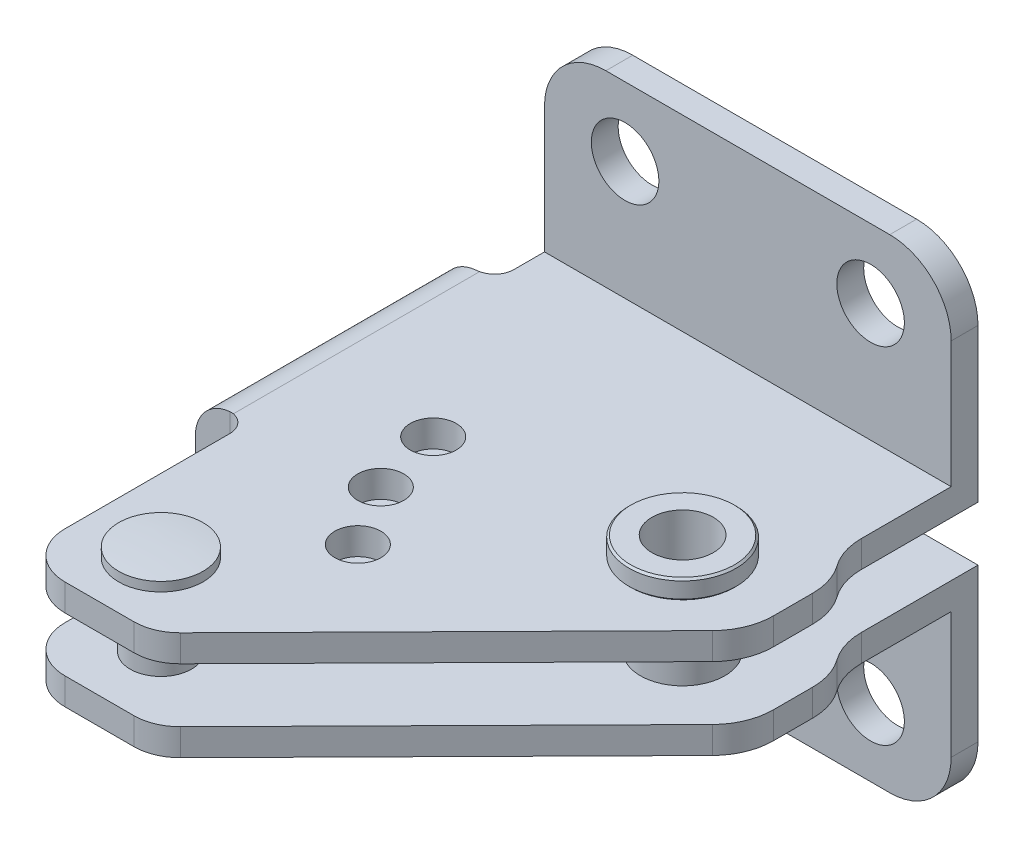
ISO-10303-21;
HEADER;
FILE_DESCRIPTION(('STEP AP214'),'2;1');
FILE_NAME('part.step','',(''),(''),'','','');
FILE_SCHEMA(('AUTOMOTIVE_DESIGN { 1 0 10303 214 1 1 1 1 }'));
ENDSEC;
DATA;
#1=APPLICATION_CONTEXT('core data for automotive mechanical design processes');
#2=APPLICATION_PROTOCOL_DEFINITION('international standard','automotive_design',2000,#1);
#3=PRODUCT_CONTEXT('',#1,'mechanical');
#4=PRODUCT('Part','Part','',(#3));
#5=PRODUCT_RELATED_PRODUCT_CATEGORY('part','',(#4));
#6=PRODUCT_DEFINITION_FORMATION('','',#4);
#7=PRODUCT_DEFINITION_CONTEXT('part definition',#1,'design');
#8=PRODUCT_DEFINITION('design','',#6,#7);
#9=PRODUCT_DEFINITION_SHAPE('','',#8);
#10=(LENGTH_UNIT() NAMED_UNIT(*) SI_UNIT(.MILLI.,.METRE.));
#11=(NAMED_UNIT(*) PLANE_ANGLE_UNIT() SI_UNIT($,.RADIAN.));
#12=(NAMED_UNIT(*) SI_UNIT($,.STERADIAN.) SOLID_ANGLE_UNIT());
#13=UNCERTAINTY_MEASURE_WITH_UNIT(LENGTH_MEASURE(1.E-05),#10,'distance_accuracy_value','');
#14=(GEOMETRIC_REPRESENTATION_CONTEXT(3) GLOBAL_UNCERTAINTY_ASSIGNED_CONTEXT((#13)) GLOBAL_UNIT_ASSIGNED_CONTEXT((#10,
#11,#12)) REPRESENTATION_CONTEXT('',''));
#15=CARTESIAN_POINT('',(0.,0.,0.));
#16=DIRECTION('',(0.,0.,1.));
#17=DIRECTION('',(1.,0.,0.));
#18=AXIS2_PLACEMENT_3D('',#15,#16,#17);
#19=CARTESIAN_POINT('',(33.,12.85,29.));
#20=DIRECTION('',(0.,1.,0.));
#21=DIRECTION('',(1.,0.,0.));
#22=AXIS2_PLACEMENT_3D('',#19,#20,#21);
#23=CYLINDRICAL_SURFACE('',#22,4.);
#24=CARTESIAN_POINT('',(33.,12.9,29.));
#25=DIRECTION('',(0.,-1.,0.));
#26=DIRECTION('',(0.,0.,1.));
#27=AXIS2_PLACEMENT_3D('',#24,#25,#26);
#28=CIRCLE('',#27,4.);
#29=CARTESIAN_POINT('',(33.,12.9,33.));
#30=VERTEX_POINT('',#29);
#31=EDGE_CURVE('E1088',#30,#30,#28,.T.);
#32=ORIENTED_EDGE('',*,*,#31,.T.);
#33=EDGE_LOOP('',(#32));
#34=FACE_BOUND('',#33,.T.);
#35=CARTESIAN_POINT('',(33.,32.1,29.));
#36=DIRECTION('',(0.,1.,0.));
#37=DIRECTION('',(0.,0.,-1.));
#38=AXIS2_PLACEMENT_3D('',#35,#36,#37);
#39=CIRCLE('',#38,4.);
#40=CARTESIAN_POINT('',(33.,32.1,25.));
#41=VERTEX_POINT('',#40);
#42=EDGE_CURVE('E1081',#41,#41,#39,.T.);
#43=ORIENTED_EDGE('',*,*,#42,.T.);
#44=EDGE_LOOP('',(#43));
#45=FACE_BOUND('',#44,.T.);
#46=ADVANCED_FACE('F15',(#34,#45),#23,.F.);
#47=CARTESIAN_POINT('',(33.,15.45,29.));
#48=DIRECTION('',(0.,-1.,0.));
#49=DIRECTION('',(-1.,0.,0.));
#50=AXIS2_PLACEMENT_3D('',#47,#48,#49);
#51=CYLINDRICAL_SURFACE('',#50,7.);
#52=CARTESIAN_POINT('',(33.,13.15,29.));
#53=DIRECTION('',(0.,-1.,0.));
#54=DIRECTION('',(0.,0.,1.));
#55=AXIS2_PLACEMENT_3D('',#52,#53,#54);
#56=CIRCLE('',#55,7.);
#57=CARTESIAN_POINT('',(33.,13.15,36.));
#58=VERTEX_POINT('',#57);
#59=EDGE_CURVE('E9',#58,#58,#56,.F.);
#60=ORIENTED_EDGE('',*,*,#59,.T.);
#61=EDGE_LOOP('',(#60));
#62=FACE_BOUND('',#61,.T.);
#63=CARTESIAN_POINT('',(33.,15.25,29.));
#64=DIRECTION('',(0.,-1.,0.));
#65=DIRECTION('',(-1.,0.,0.));
#66=AXIS2_PLACEMENT_3D('',#63,#64,#65);
#67=CIRCLE('',#66,7.);
#68=CARTESIAN_POINT('',(26.,15.25,29.));
#69=VERTEX_POINT('',#68);
#70=EDGE_CURVE('E1117',#69,#69,#67,.T.);
#71=ORIENTED_EDGE('',*,*,#70,.T.);
#72=EDGE_LOOP('',(#71));
#73=FACE_BOUND('',#72,.T.);
#74=ADVANCED_FACE('F658',(#62,#73),#51,.T.);
#75=CARTESIAN_POINT('',(33.,15.45,29.));
#76=DIRECTION('',(0.,-1.,0.));
#77=DIRECTION('',(-1.,0.,0.));
#78=AXIS2_PLACEMENT_3D('',#75,#76,#77);
#79=CONICAL_SURFACE('',#78,6.8,0.785398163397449);
#80=ORIENTED_EDGE('',*,*,#70,.F.);
#81=EDGE_LOOP('',(#80));
#82=FACE_BOUND('',#81,.T.);
#83=CARTESIAN_POINT('',(33.,15.45,29.));
#84=DIRECTION('',(0.,-1.,0.));
#85=DIRECTION('',(-1.,0.,0.));
#86=AXIS2_PLACEMENT_3D('',#83,#84,#85);
#87=CIRCLE('',#86,6.8);
#88=CARTESIAN_POINT('',(26.2,15.45,29.));
#89=VERTEX_POINT('',#88);
#90=EDGE_CURVE('E638',#89,#89,#87,.T.);
#91=ORIENTED_EDGE('',*,*,#90,.T.);
#92=EDGE_LOOP('',(#91));
#93=FACE_BOUND('',#92,.T.);
#94=ADVANCED_FACE('F665',(#82,#93),#79,.T.);
#95=CARTESIAN_POINT('',(33.,12.85,29.));
#96=DIRECTION('',(0.,1.,0.));
#97=DIRECTION('',(1.,0.,0.));
#98=AXIS2_PLACEMENT_3D('',#95,#96,#97);
#99=CYLINDRICAL_SURFACE('',#98,7.);
#100=CARTESIAN_POINT('',(33.,31.85,29.));
#101=DIRECTION('',(0.,1.,0.));
#102=DIRECTION('',(0.,0.,-1.));
#103=AXIS2_PLACEMENT_3D('',#100,#101,#102);
#104=CIRCLE('',#103,7.);
#105=CARTESIAN_POINT('',(33.,31.85,22.));
#106=VERTEX_POINT('',#105);
#107=EDGE_CURVE('E637',#106,#106,#104,.F.);
#108=ORIENTED_EDGE('',*,*,#107,.T.);
#109=EDGE_LOOP('',(#108));
#110=FACE_BOUND('',#109,.T.);
#111=CARTESIAN_POINT('',(33.,29.8,29.));
#112=DIRECTION('',(0.,1.,0.));
#113=DIRECTION('',(1.,0.,0.));
#114=AXIS2_PLACEMENT_3D('',#111,#112,#113);
#115=CIRCLE('',#114,7.);
#116=CARTESIAN_POINT('',(40.,29.8,29.));
#117=VERTEX_POINT('',#116);
#118=EDGE_CURVE('E1123',#117,#117,#115,.T.);
#119=ORIENTED_EDGE('',*,*,#118,.T.);
#120=EDGE_LOOP('',(#119));
#121=FACE_BOUND('',#120,.T.);
#122=ADVANCED_FACE('F707',(#110,#121),#99,.T.);
#123=CARTESIAN_POINT('',(-1.,-28.9999999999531,62.9999999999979));
#124=DIRECTION('',(0.,1.,0.));
#125=DIRECTION('',(0.,0.,1.));
#126=AXIS2_PLACEMENT_3D('',#123,#124,#125);
#127=SPHERICAL_SURFACE('',#126,59.9999999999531);
#128=CARTESIAN_POINT('',(-1.,30.7473848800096,63.));
#129=DIRECTION('',(0.,1.,0.));
#130=DIRECTION('',(0.,0.,1.));
#131=AXIS2_PLACEMENT_3D('',#128,#129,#130);
#132=CIRCLE('',#131,5.5);
#133=CARTESIAN_POINT('',(-1.,30.7473848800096,68.5));
#134=VERTEX_POINT('',#133);
#135=EDGE_CURVE('E1146',#134,#134,#132,.T.);
#136=ORIENTED_EDGE('',*,*,#135,.T.);
#137=EDGE_LOOP('',(#136));
#138=FACE_BOUND('',#137,.T.);
#139=ADVANCED_FACE('F703',(#138),#127,.T.);
#140=CARTESIAN_POINT('',(34.4999999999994,45.9999999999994,3.5));
#141=DIRECTION('',(0.,0.,-1.));
#142=DIRECTION('',(0.,-1.,0.));
#143=AXIS2_PLACEMENT_3D('',#140,#141,#142);
#144=CYLINDRICAL_SURFACE('',#143,8.00000000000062);
#145=CARTESIAN_POINT('',(34.4999999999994,45.9999999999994,0.));
#146=DIRECTION('',(0.,0.,1.));
#147=DIRECTION('',(-1.,0.,0.));
#148=AXIS2_PLACEMENT_3D('',#145,#146,#147);
#149=CIRCLE('',#148,8.00000000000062);
#150=CARTESIAN_POINT('',(42.5,46.,0.));
#151=VERTEX_POINT('',#150);
#152=CARTESIAN_POINT('',(34.5,54.,0.));
#153=VERTEX_POINT('',#152);
#154=EDGE_CURVE('E588',#151,#153,#149,.T.);
#155=ORIENTED_EDGE('',*,*,#154,.T.);
#156=DIRECTION('',(0.,0.,-1.));
#157=VECTOR('',#156,1.);
#158=CARTESIAN_POINT('',(34.5,54.,3.5));
#159=LINE('',#158,#157);
#160=CARTESIAN_POINT('',(34.5,54.,3.5));
#161=VERTEX_POINT('',#160);
#162=EDGE_CURVE('E1243',#161,#153,#159,.T.);
#163=ORIENTED_EDGE('',*,*,#162,.F.);
#164=CARTESIAN_POINT('',(34.4999999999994,45.9999999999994,3.5));
#165=DIRECTION('',(0.,0.,1.));
#166=DIRECTION('',(-1.,0.,0.));
#167=AXIS2_PLACEMENT_3D('',#164,#165,#166);
#168=CIRCLE('',#167,8.00000000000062);
#169=CARTESIAN_POINT('',(42.5,46.,3.5));
#170=VERTEX_POINT('',#169);
#171=EDGE_CURVE('E1227',#170,#161,#168,.T.);
#172=ORIENTED_EDGE('',*,*,#171,.F.);
#173=DIRECTION('',(0.,0.,-1.));
#174=VECTOR('',#173,1.);
#175=CARTESIAN_POINT('',(42.5,46.,3.5));
#176=LINE('',#175,#174);
#177=EDGE_CURVE('E1173',#170,#151,#176,.T.);
#178=ORIENTED_EDGE('',*,*,#177,.T.);
#179=EDGE_LOOP('',(#155,#163,#172,#178));
#180=FACE_BOUND('',#179,.T.);
#181=ADVANCED_FACE('F706',(#180),#144,.T.);
#182=CARTESIAN_POINT('',(34.5,54.,3.5));
#183=DIRECTION('',(0.,-1.,0.));
#184=DIRECTION('',(1.,0.,0.));
#185=AXIS2_PLACEMENT_3D('',#182,#183,#184);
#186=PLANE('',#185);
#187=DIRECTION('',(-1.,0.,0.));
#188=VECTOR('',#187,1.);
#189=CARTESIAN_POINT('',(34.5,54.,0.));
#190=LINE('',#189,#188);
#191=CARTESIAN_POINT('',(-2.5,54.,0.));
#192=VERTEX_POINT('',#191);
#193=EDGE_CURVE('E1049',#153,#192,#190,.T.);
#194=ORIENTED_EDGE('',*,*,#193,.T.);
#195=DIRECTION('',(0.,0.,-1.));
#196=VECTOR('',#195,1.);
#197=CARTESIAN_POINT('',(-2.5,54.,3.5));
#198=LINE('',#197,#196);
#199=CARTESIAN_POINT('',(-2.5,54.,3.5));
#200=VERTEX_POINT('',#199);
#201=EDGE_CURVE('E1240',#200,#192,#198,.T.);
#202=ORIENTED_EDGE('',*,*,#201,.F.);
#203=DIRECTION('',(-1.,0.,0.));
#204=VECTOR('',#203,1.);
#205=CARTESIAN_POINT('',(34.5,54.,3.5));
#206=LINE('',#205,#204);
#207=EDGE_CURVE('E1248',#161,#200,#206,.T.);
#208=ORIENTED_EDGE('',*,*,#207,.F.);
#209=ORIENTED_EDGE('',*,*,#162,.T.);
#210=EDGE_LOOP('',(#194,#202,#208,#209));
#211=FACE_BOUND('',#210,.T.);
#212=ADVANCED_FACE('F717',(#211),#186,.F.);
#213=CARTESIAN_POINT('',(32.,45.,3.5));
#214=DIRECTION('',(0.,0.,-1.));
#215=DIRECTION('',(0.,-1.,0.));
#216=AXIS2_PLACEMENT_3D('',#213,#214,#215);
#217=CYLINDRICAL_SURFACE('',#216,4.4);
#218=CARTESIAN_POINT('',(32.,45.,3.5));
#219=DIRECTION('',(0.,0.,-1.));
#220=DIRECTION('',(-1.,0.,0.));
#221=AXIS2_PLACEMENT_3D('',#218,#219,#220);
#222=CIRCLE('',#221,4.4);
#223=CARTESIAN_POINT('',(27.6,45.,3.5));
#224=VERTEX_POINT('',#223);
#225=EDGE_CURVE('E1070',#224,#224,#222,.T.);
#226=ORIENTED_EDGE('',*,*,#225,.F.);
#227=EDGE_LOOP('',(#226));
#228=FACE_BOUND('',#227,.T.);
#229=CARTESIAN_POINT('',(32.,45.,0.));
#230=DIRECTION('',(0.,0.,-1.));
#231=DIRECTION('',(-1.,0.,0.));
#232=AXIS2_PLACEMENT_3D('',#229,#230,#231);
#233=CIRCLE('',#232,4.4);
#234=CARTESIAN_POINT('',(27.6,45.,0.));
#235=VERTEX_POINT('',#234);
#236=EDGE_CURVE('E1072',#235,#235,#233,.T.);
#237=ORIENTED_EDGE('',*,*,#236,.T.);
#238=EDGE_LOOP('',(#237));
#239=FACE_BOUND('',#238,.T.);
#240=ADVANCED_FACE('F713',(#228,#239),#217,.F.);
#241=CARTESIAN_POINT('',(0.,45.,3.5));
#242=DIRECTION('',(0.,0.,-1.));
#243=DIRECTION('',(0.,-1.,0.));
#244=AXIS2_PLACEMENT_3D('',#241,#242,#243);
#245=CYLINDRICAL_SURFACE('',#244,4.4);
#246=CARTESIAN_POINT('',(0.,45.,3.5));
#247=DIRECTION('',(0.,0.,-1.));
#248=DIRECTION('',(-1.,0.,0.));
#249=AXIS2_PLACEMENT_3D('',#246,#247,#248);
#250=CIRCLE('',#249,4.4);
#251=CARTESIAN_POINT('',(-4.4,45.,3.5));
#252=VERTEX_POINT('',#251);
#253=EDGE_CURVE('E1076',#252,#252,#250,.T.);
#254=ORIENTED_EDGE('',*,*,#253,.F.);
#255=EDGE_LOOP('',(#254));
#256=FACE_BOUND('',#255,.T.);
#257=CARTESIAN_POINT('',(0.,45.,0.));
#258=DIRECTION('',(0.,0.,-1.));
#259=DIRECTION('',(-1.,0.,0.));
#260=AXIS2_PLACEMENT_3D('',#257,#258,#259);
#261=CIRCLE('',#260,4.4);
#262=CARTESIAN_POINT('',(-4.4,45.,0.));
#263=VERTEX_POINT('',#262);
#264=EDGE_CURVE('E1078',#263,#263,#261,.T.);
#265=ORIENTED_EDGE('',*,*,#264,.T.);
#266=EDGE_LOOP('',(#265));
#267=FACE_BOUND('',#266,.T.);
#268=ADVANCED_FACE('F709',(#256,#267),#245,.F.);
#269=CARTESIAN_POINT('',(-2.49999999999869,45.9999999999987,3.5));
#270=DIRECTION('',(0.,0.,-1.));
#271=DIRECTION('',(0.,-1.,0.));
#272=AXIS2_PLACEMENT_3D('',#269,#270,#271);
#273=CYLINDRICAL_SURFACE('',#272,8.0000000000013);
#274=CARTESIAN_POINT('',(-2.49999999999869,45.9999999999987,0.));
#275=DIRECTION('',(0.,0.,1.));
#276=DIRECTION('',(1.,0.,0.));
#277=AXIS2_PLACEMENT_3D('',#274,#275,#276);
#278=CIRCLE('',#277,8.0000000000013);
#279=CARTESIAN_POINT('',(-10.5,45.9999999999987,0.));
#280=VERTEX_POINT('',#279);
#281=EDGE_CURVE('E1045',#192,#280,#278,.T.);
#282=ORIENTED_EDGE('',*,*,#281,.T.);
#283=DIRECTION('',(0.,0.,-1.));
#284=VECTOR('',#283,1.);
#285=CARTESIAN_POINT('',(-10.5,45.9999999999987,3.5));
#286=LINE('',#285,#284);
#287=CARTESIAN_POINT('',(-10.5,45.9999999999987,3.5));
#288=VERTEX_POINT('',#287);
#289=EDGE_CURVE('E1238',#288,#280,#286,.T.);
#290=ORIENTED_EDGE('',*,*,#289,.F.);
#291=CARTESIAN_POINT('',(-2.49999999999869,45.9999999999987,3.5));
#292=DIRECTION('',(0.,0.,1.));
#293=DIRECTION('',(1.,0.,0.));
#294=AXIS2_PLACEMENT_3D('',#291,#292,#293);
#295=CIRCLE('',#294,8.0000000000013);
#296=EDGE_CURVE('E1213',#200,#288,#295,.T.);
#297=ORIENTED_EDGE('',*,*,#296,.F.);
#298=ORIENTED_EDGE('',*,*,#201,.T.);
#299=EDGE_LOOP('',(#282,#290,#297,#298));
#300=FACE_BOUND('',#299,.T.);
#301=ADVANCED_FACE('F712',(#300),#273,.T.);
#302=CARTESIAN_POINT('',(33.,29.55,29.));
#303=DIRECTION('',(0.,1.,0.));
#304=DIRECTION('',(1.,0.,0.));
#305=AXIS2_PLACEMENT_3D('',#302,#303,#304);
#306=CONICAL_SURFACE('',#305,6.75,0.785398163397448);
#307=ORIENTED_EDGE('',*,*,#118,.F.);
#308=EDGE_LOOP('',(#307));
#309=FACE_BOUND('',#308,.T.);
#310=CARTESIAN_POINT('',(33.,29.55,29.));
#311=DIRECTION('',(0.,1.,0.));
#312=DIRECTION('',(1.,0.,0.));
#313=AXIS2_PLACEMENT_3D('',#310,#311,#312);
#314=CIRCLE('',#313,6.75);
#315=CARTESIAN_POINT('',(39.75,29.55,29.));
#316=VERTEX_POINT('',#315);
#317=EDGE_CURVE('E1126',#316,#316,#314,.T.);
#318=ORIENTED_EDGE('',*,*,#317,.T.);
#319=EDGE_LOOP('',(#318));
#320=FACE_BOUND('',#319,.T.);
#321=ADVANCED_FACE('F701',(#309,#320),#306,.T.);
#322=CARTESIAN_POINT('',(-1.,18.0877132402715,63.));
#323=DIRECTION('',(0.,1.,0.));
#324=DIRECTION('',(0.,0.,1.));
#325=AXIS2_PLACEMENT_3D('',#322,#323,#324);
#326=CYLINDRICAL_SURFACE('',#325,5.5);
#327=CARTESIAN_POINT('',(-1.,29.55,63.));
#328=DIRECTION('',(0.,1.,0.));
#329=DIRECTION('',(0.,0.,-1.));
#330=AXIS2_PLACEMENT_3D('',#327,#328,#329);
#331=CIRCLE('',#330,5.5);
#332=CARTESIAN_POINT('',(-1.,29.55,57.5));
#333=VERTEX_POINT('',#332);
#334=EDGE_CURVE('E606',#333,#333,#331,.F.);
#335=ORIENTED_EDGE('',*,*,#334,.F.);
#336=EDGE_LOOP('',(#335));
#337=FACE_BOUND('',#336,.T.);
#338=ORIENTED_EDGE('',*,*,#135,.F.);
#339=EDGE_LOOP('',(#338));
#340=FACE_BOUND('',#339,.T.);
#341=ADVANCED_FACE('F697',(#337,#340),#326,.T.);
#342=CARTESIAN_POINT('',(34.4999999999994,45.9999999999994,3.5));
#343=DIRECTION('',(0.,0.,1.));
#344=DIRECTION('',(0.,1.,0.));
#345=AXIS2_PLACEMENT_3D('',#342,#343,#344);
#346=PLANE('',#345);
#347=ORIENTED_EDGE('',*,*,#253,.T.);
#348=EDGE_LOOP('',(#347));
#349=FACE_BOUND('',#348,.T.);
#350=ORIENTED_EDGE('',*,*,#225,.T.);
#351=EDGE_LOOP('',(#350));
#352=FACE_BOUND('',#351,.T.);
#353=DIRECTION('',(0.,-1.,0.));
#354=VECTOR('',#353,1.);
#355=CARTESIAN_POINT('',(-10.5,46.,3.5));
#356=LINE('',#355,#354);
#357=CARTESIAN_POINT('',(-10.5,29.55,3.5));
#358=VERTEX_POINT('',#357);
#359=EDGE_CURVE('E1211',#288,#358,#356,.T.);
#360=ORIENTED_EDGE('',*,*,#359,.T.);
#361=DIRECTION('',(1.,0.,0.));
#362=VECTOR('',#361,1.);
#363=CARTESIAN_POINT('',(37.5000000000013,29.55,3.5));
#364=LINE('',#363,#362);
#365=CARTESIAN_POINT('',(42.5,29.55,3.5));
#366=VERTEX_POINT('',#365);
#367=EDGE_CURVE('E462',#358,#366,#364,.T.);
#368=ORIENTED_EDGE('',*,*,#367,.T.);
#369=DIRECTION('',(0.,1.,0.));
#370=VECTOR('',#369,1.);
#371=CARTESIAN_POINT('',(42.5,-1.,3.5));
#372=LINE('',#371,#370);
#373=EDGE_CURVE('E1036',#366,#170,#372,.T.);
#374=ORIENTED_EDGE('',*,*,#373,.T.);
#375=ORIENTED_EDGE('',*,*,#171,.T.);
#376=ORIENTED_EDGE('',*,*,#207,.T.);
#377=ORIENTED_EDGE('',*,*,#296,.T.);
#378=EDGE_LOOP('',(#360,#368,#374,#375,#376,#377));
#379=FACE_BOUND('',#378,.T.);
#380=ADVANCED_FACE('F700',(#349,#352,#379),#346,.T.);
#381=CARTESIAN_POINT('',(10.358712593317,29.55,48.681770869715));
#382=DIRECTION('',(0.,-1.,0.));
#383=DIRECTION('',(1.,0.,0.));
#384=AXIS2_PLACEMENT_3D('',#381,#382,#383);
#385=CYLINDRICAL_SURFACE('',#384,3.);
#386=CARTESIAN_POINT('',(10.358712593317,26.05,48.681770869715));
#387=DIRECTION('',(0.,-1.,0.));
#388=DIRECTION('',(1.,0.,0.));
#389=AXIS2_PLACEMENT_3D('',#386,#387,#388);
#390=CIRCLE('',#389,3.);
#391=CARTESIAN_POINT('',(13.358712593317,26.05,48.681770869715));
#392=VERTEX_POINT('',#391);
#393=EDGE_CURVE('E630',#392,#392,#390,.F.);
#394=ORIENTED_EDGE('',*,*,#393,.F.);
#395=EDGE_LOOP('',(#394));
#396=FACE_BOUND('',#395,.T.);
#397=CARTESIAN_POINT('',(10.358712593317,29.55,48.681770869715));
#398=DIRECTION('',(0.,1.,0.));
#399=DIRECTION('',(-1.,0.,0.));
#400=AXIS2_PLACEMENT_3D('',#397,#398,#399);
#401=CIRCLE('',#400,3.);
#402=CARTESIAN_POINT('',(7.358712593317,29.55,48.681770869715));
#403=VERTEX_POINT('',#402);
#404=EDGE_CURVE('E633',#403,#403,#401,.T.);
#405=ORIENTED_EDGE('',*,*,#404,.T.);
#406=EDGE_LOOP('',(#405));
#407=FACE_BOUND('',#406,.T.);
#408=ADVANCED_FACE('F729',(#396,#407),#385,.F.);
#409=CARTESIAN_POINT('',(3.114159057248,29.55,31.61467228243));
#410=DIRECTION('',(0.,-1.,0.));
#411=DIRECTION('',(1.,0.,0.));
#412=AXIS2_PLACEMENT_3D('',#409,#410,#411);
#413=CYLINDRICAL_SURFACE('',#412,3.);
#414=CARTESIAN_POINT('',(3.114159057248,26.05,31.61467228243));
#415=DIRECTION('',(0.,-1.,0.));
#416=DIRECTION('',(1.,0.,0.));
#417=AXIS2_PLACEMENT_3D('',#414,#415,#416);
#418=CIRCLE('',#417,3.);
#419=CARTESIAN_POINT('',(6.114159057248,26.05,31.61467228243));
#420=VERTEX_POINT('',#419);
#421=EDGE_CURVE('E614',#420,#420,#418,.F.);
#422=ORIENTED_EDGE('',*,*,#421,.F.);
#423=EDGE_LOOP('',(#422));
#424=FACE_BOUND('',#423,.T.);
#425=CARTESIAN_POINT('',(3.114159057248,29.55,31.61467228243));
#426=DIRECTION('',(0.,1.,0.));
#427=DIRECTION('',(-1.,0.,0.));
#428=AXIS2_PLACEMENT_3D('',#425,#426,#427);
#429=CIRCLE('',#428,3.);
#430=CARTESIAN_POINT('',(0.114159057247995,29.55,31.61467228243));
#431=VERTEX_POINT('',#430);
#432=EDGE_CURVE('E617',#431,#431,#429,.T.);
#433=ORIENTED_EDGE('',*,*,#432,.T.);
#434=EDGE_LOOP('',(#433));
#435=FACE_BOUND('',#434,.T.);
#436=ADVANCED_FACE('F732',(#424,#435),#413,.F.);
#437=CARTESIAN_POINT('',(-4.499999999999,15.45,65.999999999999));
#438=DIRECTION('',(0.,1.,0.));
#439=DIRECTION('',(-1.,0.,0.));
#440=AXIS2_PLACEMENT_3D('',#437,#438,#439);
#441=CYLINDRICAL_SURFACE('',#440,6.00000000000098);
#442=DIRECTION('',(0.,1.,0.));
#443=VECTOR('',#442,1.);
#444=CARTESIAN_POINT('',(-10.5,15.45,66.));
#445=LINE('',#444,#443);
#446=CARTESIAN_POINT('',(-10.5,26.05,66.));
#447=VERTEX_POINT('',#446);
#448=CARTESIAN_POINT('',(-10.5,29.55,66.));
#449=VERTEX_POINT('',#448);
#450=EDGE_CURVE('E417',#447,#449,#445,.T.);
#451=ORIENTED_EDGE('',*,*,#450,.F.);
#452=CARTESIAN_POINT('',(-4.499999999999,26.05,65.999999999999));
#453=DIRECTION('',(0.,-1.,0.));
#454=DIRECTION('',(1.,0.,0.));
#455=AXIS2_PLACEMENT_3D('',#452,#453,#454);
#456=CIRCLE('',#455,6.00000000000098);
#457=CARTESIAN_POINT('',(-4.5,26.05,72.));
#458=VERTEX_POINT('',#457);
#459=EDGE_CURVE('E824',#447,#458,#456,.F.);
#460=ORIENTED_EDGE('',*,*,#459,.T.);
#461=DIRECTION('',(0.,1.,0.));
#462=VECTOR('',#461,1.);
#463=CARTESIAN_POINT('',(-4.5,15.45,72.));
#464=LINE('',#463,#462);
#465=CARTESIAN_POINT('',(-4.5,29.55,72.));
#466=VERTEX_POINT('',#465);
#467=EDGE_CURVE('E413',#458,#466,#464,.T.);
#468=ORIENTED_EDGE('',*,*,#467,.T.);
#469=CARTESIAN_POINT('',(-4.499999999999,29.55,65.999999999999));
#470=DIRECTION('',(0.,1.,0.));
#471=DIRECTION('',(-1.,0.,0.));
#472=AXIS2_PLACEMENT_3D('',#469,#470,#471);
#473=CIRCLE('',#472,6.00000000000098);
#474=EDGE_CURVE('E336',#449,#466,#473,.T.);
#475=ORIENTED_EDGE('',*,*,#474,.F.);
#476=EDGE_LOOP('',(#451,#460,#468,#475));
#477=FACE_BOUND('',#476,.T.);
#478=ADVANCED_FACE('F747',(#477),#441,.T.);
#479=CARTESIAN_POINT('',(-4.5,15.45,72.));
#480=DIRECTION('',(0.,0.,1.));
#481=DIRECTION('',(0.,1.,0.));
#482=AXIS2_PLACEMENT_3D('',#479,#480,#481);
#483=PLANE('',#482);
#484=ORIENTED_EDGE('',*,*,#467,.F.);
#485=DIRECTION('',(1.,0.,0.));
#486=VECTOR('',#485,1.);
#487=CARTESIAN_POINT('',(-4.5,26.05,72.));
#488=LINE('',#487,#486);
#489=CARTESIAN_POINT('',(4.5,26.05,72.));
#490=VERTEX_POINT('',#489);
#491=EDGE_CURVE('E821',#458,#490,#488,.T.);
#492=ORIENTED_EDGE('',*,*,#491,.T.);
#493=DIRECTION('',(0.,1.,0.));
#494=VECTOR('',#493,1.);
#495=CARTESIAN_POINT('',(4.5,15.45,72.));
#496=LINE('',#495,#494);
#497=CARTESIAN_POINT('',(4.5,29.55,72.));
#498=VERTEX_POINT('',#497);
#499=EDGE_CURVE('E409',#490,#498,#496,.T.);
#500=ORIENTED_EDGE('',*,*,#499,.T.);
#501=DIRECTION('',(1.,0.,0.));
#502=VECTOR('',#501,1.);
#503=CARTESIAN_POINT('',(-4.5,29.55,72.));
#504=LINE('',#503,#502);
#505=EDGE_CURVE('E344',#466,#498,#504,.T.);
#506=ORIENTED_EDGE('',*,*,#505,.F.);
#507=EDGE_LOOP('',(#484,#492,#500,#506));
#508=FACE_BOUND('',#507,.T.);
#509=ADVANCED_FACE('F955',(#508),#483,.T.);
#510=CARTESIAN_POINT('',(4.5000000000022,15.45,66.0000000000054));
#511=DIRECTION('',(0.,1.,0.));
#512=DIRECTION('',(-1.,0.,0.));
#513=AXIS2_PLACEMENT_3D('',#510,#511,#512);
#514=CYLINDRICAL_SURFACE('',#513,5.99999999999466);
#515=ORIENTED_EDGE('',*,*,#499,.F.);
#516=CARTESIAN_POINT('',(4.5000000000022,26.05,66.0000000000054));
#517=DIRECTION('',(0.,-1.,0.));
#518=DIRECTION('',(1.,0.,0.));
#519=AXIS2_PLACEMENT_3D('',#516,#517,#518);
#520=CIRCLE('',#519,5.99999999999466);
#521=CARTESIAN_POINT('',(8.773218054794,26.05,70.211841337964));
#522=VERTEX_POINT('',#521);
#523=EDGE_CURVE('E818',#490,#522,#520,.F.);
#524=ORIENTED_EDGE('',*,*,#523,.T.);
#525=DIRECTION('',(0.,1.,0.));
#526=VECTOR('',#525,1.);
#527=CARTESIAN_POINT('',(8.773218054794,15.45,70.211841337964));
#528=LINE('',#527,#526);
#529=CARTESIAN_POINT('',(8.773218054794,29.55,70.211841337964));
#530=VERTEX_POINT('',#529);
#531=EDGE_CURVE('E405',#522,#530,#528,.T.);
#532=ORIENTED_EDGE('',*,*,#531,.T.);
#533=CARTESIAN_POINT('',(4.5000000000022,29.55,66.0000000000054));
#534=DIRECTION('',(0.,1.,0.));
#535=DIRECTION('',(-1.,0.,0.));
#536=AXIS2_PLACEMENT_3D('',#533,#534,#535);
#537=CIRCLE('',#536,5.99999999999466);
#538=EDGE_CURVE('E347',#498,#530,#537,.T.);
#539=ORIENTED_EDGE('',*,*,#538,.F.);
#540=EDGE_LOOP('',(#515,#524,#532,#539));
#541=FACE_BOUND('',#540,.T.);
#542=ADVANCED_FACE('F950',(#541),#514,.T.);
#543=CARTESIAN_POINT('',(8.773218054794,15.45,70.211841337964));
#544=DIRECTION('',(0.712203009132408,0.,0.701973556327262));
#545=DIRECTION('',(0.701973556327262,0.,-0.712203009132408));
#546=AXIS2_PLACEMENT_3D('',#543,#544,#545);
#547=PLANE('',#546);
#548=ORIENTED_EDGE('',*,*,#531,.F.);
#549=DIRECTION('',(0.701973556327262,0.,-0.712203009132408));
#550=VECTOR('',#549,1.);
#551=CARTESIAN_POINT('',(8.773218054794,26.05,70.211841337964));
#552=LINE('',#551,#550);
#553=CARTESIAN_POINT('',(43.1976240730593,26.05,35.285788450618));
#554=VERTEX_POINT('',#553);
#555=EDGE_CURVE('E815',#522,#554,#552,.T.);
#556=ORIENTED_EDGE('',*,*,#555,.T.);
#557=DIRECTION('',(0.,1.,0.));
#558=VECTOR('',#557,1.);
#559=CARTESIAN_POINT('',(43.1976240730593,15.45,35.285788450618));
#560=LINE('',#559,#558);
#561=CARTESIAN_POINT('',(43.1976240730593,29.55,35.285788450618));
#562=VERTEX_POINT('',#561);
#563=EDGE_CURVE('E401',#554,#562,#560,.T.);
#564=ORIENTED_EDGE('',*,*,#563,.T.);
#565=DIRECTION('',(0.701973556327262,0.,-0.712203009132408));
#566=VECTOR('',#565,1.);
#567=CARTESIAN_POINT('',(8.773218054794,29.55,70.211841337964));
#568=LINE('',#567,#566);
#569=EDGE_CURVE('E350',#530,#562,#568,.T.);
#570=ORIENTED_EDGE('',*,*,#569,.F.);
#571=EDGE_LOOP('',(#548,#556,#564,#570));
#572=FACE_BOUND('',#571,.T.);
#573=ADVANCED_FACE('F945',(#572),#547,.T.);
#574=CARTESIAN_POINT('',(37.5,15.45,29.67));
#575=DIRECTION('',(0.,1.,0.));
#576=DIRECTION('',(-1.,0.,0.));
#577=AXIS2_PLACEMENT_3D('',#574,#575,#576);
#578=CYLINDRICAL_SURFACE('',#577,8.00000000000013);
#579=ORIENTED_EDGE('',*,*,#563,.F.);
#580=CARTESIAN_POINT('',(37.5,26.05,29.67));
#581=DIRECTION('',(0.,-1.,0.));
#582=DIRECTION('',(1.,0.,0.));
#583=AXIS2_PLACEMENT_3D('',#580,#581,#582);
#584=CIRCLE('',#583,8.00000000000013);
#585=CARTESIAN_POINT('',(45.5,26.05,29.67));
#586=VERTEX_POINT('',#585);
#587=EDGE_CURVE('E465',#554,#586,#584,.F.);
#588=ORIENTED_EDGE('',*,*,#587,.T.);
#589=DIRECTION('',(0.,1.,0.));
#590=VECTOR('',#589,1.);
#591=CARTESIAN_POINT('',(45.5,15.45,29.67));
#592=LINE('',#591,#590);
#593=CARTESIAN_POINT('',(45.5,29.55,29.67));
#594=VERTEX_POINT('',#593);
#595=EDGE_CURVE('E395',#586,#594,#592,.T.);
#596=ORIENTED_EDGE('',*,*,#595,.T.);
#597=CARTESIAN_POINT('',(37.5,29.55,29.67));
#598=DIRECTION('',(0.,1.,0.));
#599=DIRECTION('',(-1.,0.,0.));
#600=AXIS2_PLACEMENT_3D('',#597,#598,#599);
#601=CIRCLE('',#600,8.00000000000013);
#602=EDGE_CURVE('E353',#562,#594,#601,.T.);
#603=ORIENTED_EDGE('',*,*,#602,.F.);
#604=EDGE_LOOP('',(#579,#588,#596,#603));
#605=FACE_BOUND('',#604,.T.);
#606=ADVANCED_FACE('F940',(#605),#578,.T.);
#607=CARTESIAN_POINT('',(45.5,15.45,29.67));
#608=DIRECTION('',(1.,0.,0.));
#609=DIRECTION('',(0.,1.,0.));
#610=AXIS2_PLACEMENT_3D('',#607,#608,#609);
#611=PLANE('',#610);
#612=ORIENTED_EDGE('',*,*,#595,.F.);
#613=DIRECTION('',(0.,0.,-1.));
#614=VECTOR('',#613,1.);
#615=CARTESIAN_POINT('',(45.5,26.05,29.67));
#616=LINE('',#615,#614);
#617=CARTESIAN_POINT('',(45.5,26.05,24.54));
#618=VERTEX_POINT('',#617);
#619=EDGE_CURVE('E831',#586,#618,#616,.T.);
#620=ORIENTED_EDGE('',*,*,#619,.T.);
#621=DIRECTION('',(0.,1.,0.));
#622=VECTOR('',#621,1.);
#623=CARTESIAN_POINT('',(45.5,15.45,24.54));
#624=LINE('',#623,#622);
#625=CARTESIAN_POINT('',(45.5,29.55,24.54));
#626=VERTEX_POINT('',#625);
#627=EDGE_CURVE('E458',#618,#626,#624,.T.);
#628=ORIENTED_EDGE('',*,*,#627,.T.);
#629=DIRECTION('',(0.,0.,-1.));
#630=VECTOR('',#629,1.);
#631=CARTESIAN_POINT('',(45.5,29.55,29.67));
#632=LINE('',#631,#630);
#633=EDGE_CURVE('E357',#594,#626,#632,.T.);
#634=ORIENTED_EDGE('',*,*,#633,.F.);
#635=EDGE_LOOP('',(#612,#620,#628,#634));
#636=FACE_BOUND('',#635,.T.);
#637=ADVANCED_FACE('F988',(#636),#611,.T.);
#638=CARTESIAN_POINT('',(37.5000000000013,15.45,24.54));
#639=DIRECTION('',(0.,1.,0.));
#640=DIRECTION('',(-1.,0.,0.));
#641=AXIS2_PLACEMENT_3D('',#638,#639,#640);
#642=CYLINDRICAL_SURFACE('',#641,7.99999999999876);
#643=ORIENTED_EDGE('',*,*,#627,.F.);
#644=CARTESIAN_POINT('',(37.5000000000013,26.05,24.54));
#645=DIRECTION('',(0.,-1.,0.));
#646=DIRECTION('',(1.,0.,0.));
#647=AXIS2_PLACEMENT_3D('',#644,#645,#646);
#648=CIRCLE('',#647,7.99999999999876);
#649=CARTESIAN_POINT('',(44.,26.05,19.876310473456));
#650=VERTEX_POINT('',#649);
#651=EDGE_CURVE('E834',#618,#650,#648,.F.);
#652=ORIENTED_EDGE('',*,*,#651,.T.);
#653=DIRECTION('',(0.,1.,0.));
#654=VECTOR('',#653,1.);
#655=CARTESIAN_POINT('',(44.,15.45,19.876310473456));
#656=LINE('',#655,#654);
#657=CARTESIAN_POINT('',(44.,29.55,19.876310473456));
#658=VERTEX_POINT('',#657);
#659=EDGE_CURVE('E454',#650,#658,#656,.T.);
#660=ORIENTED_EDGE('',*,*,#659,.T.);
#661=CARTESIAN_POINT('',(37.5000000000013,29.55,24.54));
#662=DIRECTION('',(0.,1.,0.));
#663=DIRECTION('',(-1.,0.,0.));
#664=AXIS2_PLACEMENT_3D('',#661,#662,#663);
#665=CIRCLE('',#664,7.99999999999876);
#666=EDGE_CURVE('E360',#626,#658,#665,.T.);
#667=ORIENTED_EDGE('',*,*,#666,.F.);
#668=EDGE_LOOP('',(#643,#652,#660,#667));
#669=FACE_BOUND('',#668,.T.);
#670=ADVANCED_FACE('F1193',(#669),#642,.T.);
#671=CARTESIAN_POINT('',(50.5000000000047,15.45,15.2126209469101));
#672=DIRECTION('',(0.,1.,0.));
#673=DIRECTION('',(-1.,0.,0.));
#674=AXIS2_PLACEMENT_3D('',#671,#672,#673);
#675=CYLINDRICAL_SURFACE('',#674,8.00000000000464);
#676=ORIENTED_EDGE('',*,*,#659,.F.);
#677=CARTESIAN_POINT('',(50.5000000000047,26.05,15.2126209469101));
#678=DIRECTION('',(0.,-1.,0.));
#679=DIRECTION('',(1.,0.,0.));
#680=AXIS2_PLACEMENT_3D('',#677,#678,#679);
#681=CIRCLE('',#680,8.00000000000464);
#682=CARTESIAN_POINT('',(42.5,26.05,15.2126209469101));
#683=VERTEX_POINT('',#682);
#684=EDGE_CURVE('E837',#650,#683,#681,.T.);
#685=ORIENTED_EDGE('',*,*,#684,.T.);
#686=DIRECTION('',(0.,1.,0.));
#687=VECTOR('',#686,1.);
#688=CARTESIAN_POINT('',(42.5,15.45,15.2126209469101));
#689=LINE('',#688,#687);
#690=CARTESIAN_POINT('',(42.5,29.55,15.2126209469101));
#691=VERTEX_POINT('',#690);
#692=EDGE_CURVE('E450',#683,#691,#689,.T.);
#693=ORIENTED_EDGE('',*,*,#692,.T.);
#694=CARTESIAN_POINT('',(50.5000000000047,29.55,15.2126209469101));
#695=DIRECTION('',(0.,-1.,0.));
#696=DIRECTION('',(1.,0.,0.));
#697=AXIS2_PLACEMENT_3D('',#694,#695,#696);
#698=CIRCLE('',#697,8.00000000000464);
#699=EDGE_CURVE('E994',#658,#691,#698,.T.);
#700=ORIENTED_EDGE('',*,*,#699,.F.);
#701=EDGE_LOOP('',(#676,#685,#693,#700));
#702=FACE_BOUND('',#701,.T.);
#703=ADVANCED_FACE('F1000',(#702),#675,.F.);
#704=CARTESIAN_POINT('',(42.5,15.45,15.212620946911));
#705=DIRECTION('',(1.,0.,0.));
#706=DIRECTION('',(0.,1.,0.));
#707=AXIS2_PLACEMENT_3D('',#704,#705,#706);
#708=PLANE('',#707);
#709=ORIENTED_EDGE('',*,*,#692,.F.);
#710=DIRECTION('',(0.,0.,-1.));
#711=VECTOR('',#710,1.);
#712=CARTESIAN_POINT('',(42.5,26.05,15.212620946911));
#713=LINE('',#712,#711);
#714=CARTESIAN_POINT('',(42.5,26.05,0.));
#715=VERTEX_POINT('',#714);
#716=EDGE_CURVE('E840',#683,#715,#713,.T.);
#717=ORIENTED_EDGE('',*,*,#716,.T.);
#718=DIRECTION('',(0.,1.,0.));
#719=VECTOR('',#718,1.);
#720=CARTESIAN_POINT('',(42.5,15.45,0.));
#721=LINE('',#720,#719);
#722=EDGE_CURVE('E445',#715,#151,#721,.T.);
#723=ORIENTED_EDGE('',*,*,#722,.T.);
#724=ORIENTED_EDGE('',*,*,#177,.F.);
#725=ORIENTED_EDGE('',*,*,#373,.F.);
#726=DIRECTION('',(0.,0.,-1.));
#727=VECTOR('',#726,1.);
#728=CARTESIAN_POINT('',(42.5,29.55,15.212620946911));
#729=LINE('',#728,#727);
#730=EDGE_CURVE('E1002',#691,#366,#729,.T.);
#731=ORIENTED_EDGE('',*,*,#730,.F.);
#732=EDGE_LOOP('',(#709,#717,#723,#724,#725,#731));
#733=FACE_BOUND('',#732,.T.);
#734=ADVANCED_FACE('F1207',(#733),#708,.T.);
#735=CARTESIAN_POINT('',(42.5,15.45,0.));
#736=DIRECTION('',(0.,0.,-1.));
#737=DIRECTION('',(0.,-1.,0.));
#738=AXIS2_PLACEMENT_3D('',#735,#736,#737);
#739=PLANE('',#738);
#740=ORIENTED_EDGE('',*,*,#264,.F.);
#741=EDGE_LOOP('',(#740));
#742=FACE_BOUND('',#741,.T.);
#743=ORIENTED_EDGE('',*,*,#236,.F.);
#744=EDGE_LOOP('',(#743));
#745=FACE_BOUND('',#744,.T.);
#746=ORIENTED_EDGE('',*,*,#722,.F.);
#747=DIRECTION('',(-1.,0.,0.));
#748=VECTOR('',#747,1.);
#749=CARTESIAN_POINT('',(49.,26.05,0.));
#750=LINE('',#749,#748);
#751=CARTESIAN_POINT('',(-10.5,26.05,0.));
#752=VERTEX_POINT('',#751);
#753=EDGE_CURVE('E798',#715,#752,#750,.T.);
#754=ORIENTED_EDGE('',*,*,#753,.T.);
#755=DIRECTION('',(0.,1.,0.));
#756=VECTOR('',#755,1.);
#757=CARTESIAN_POINT('',(-10.5,15.45,0.));
#758=LINE('',#757,#756);
#759=EDGE_CURVE('E440',#752,#280,#758,.T.);
#760=ORIENTED_EDGE('',*,*,#759,.T.);
#761=ORIENTED_EDGE('',*,*,#281,.F.);
#762=ORIENTED_EDGE('',*,*,#193,.F.);
#763=ORIENTED_EDGE('',*,*,#154,.F.);
#764=EDGE_LOOP('',(#746,#754,#760,#761,#762,#763));
#765=FACE_BOUND('',#764,.T.);
#766=ADVANCED_FACE('F740',(#742,#745,#765),#739,.T.);
#767=CARTESIAN_POINT('',(5.384854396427,29.55,40.721933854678));
#768=DIRECTION('',(0.,-1.,0.));
#769=DIRECTION('',(1.,0.,0.));
#770=AXIS2_PLACEMENT_3D('',#767,#768,#769);
#771=CYLINDRICAL_SURFACE('',#770,3.);
#772=CARTESIAN_POINT('',(5.384854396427,26.05,40.721933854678));
#773=DIRECTION('',(0.,-1.,0.));
#774=DIRECTION('',(1.,0.,0.));
#775=AXIS2_PLACEMENT_3D('',#772,#773,#774);
#776=CIRCLE('',#775,3.);
#777=CARTESIAN_POINT('',(8.384854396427,26.05,40.721933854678));
#778=VERTEX_POINT('',#777);
#779=EDGE_CURVE('E622',#778,#778,#776,.F.);
#780=ORIENTED_EDGE('',*,*,#779,.F.);
#781=EDGE_LOOP('',(#780));
#782=FACE_BOUND('',#781,.T.);
#783=CARTESIAN_POINT('',(5.384854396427,29.55,40.721933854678));
#784=DIRECTION('',(0.,1.,0.));
#785=DIRECTION('',(-1.,0.,0.));
#786=AXIS2_PLACEMENT_3D('',#783,#784,#785);
#787=CIRCLE('',#786,3.);
#788=CARTESIAN_POINT('',(2.384854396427,29.55,40.721933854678));
#789=VERTEX_POINT('',#788);
#790=EDGE_CURVE('E625',#789,#789,#787,.T.);
#791=ORIENTED_EDGE('',*,*,#790,.T.);
#792=EDGE_LOOP('',(#791));
#793=FACE_BOUND('',#792,.T.);
#794=ADVANCED_FACE('F677',(#782,#793),#771,.F.);
#795=CARTESIAN_POINT('',(-1.,16.5,63.));
#796=DIRECTION('',(0.,-1.,0.));
#797=DIRECTION('',(0.,0.,-1.));
#798=AXIS2_PLACEMENT_3D('',#795,#796,#797);
#799=CONICAL_SURFACE('',#798,2.75,1.04719755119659);
#800=CARTESIAN_POINT('',(-1.,18.0877132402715,63.));
#801=VERTEX_POINT('',#800);
#802=VERTEX_LOOP('',#801);
#803=FACE_BOUND('',#802,.T.);
#804=CARTESIAN_POINT('',(-1.,16.5,63.));
#805=DIRECTION('',(0.,1.,0.));
#806=DIRECTION('',(0.,0.,1.));
#807=AXIS2_PLACEMENT_3D('',#804,#805,#806);
#808=CIRCLE('',#807,2.75);
#809=CARTESIAN_POINT('',(-1.,16.5,65.75));
#810=VERTEX_POINT('',#809);
#811=EDGE_CURVE('E598',#810,#810,#808,.T.);
#812=ORIENTED_EDGE('',*,*,#811,.F.);
#813=EDGE_LOOP('',(#812));
#814=FACE_BOUND('',#813,.T.);
#815=ADVANCED_FACE('F673',(#803,#814),#799,.F.);
#816=CARTESIAN_POINT('',(-10.5,15.45,0.));
#817=DIRECTION('',(-1.,0.,0.));
#818=DIRECTION('',(0.,-1.,0.));
#819=AXIS2_PLACEMENT_3D('',#816,#817,#818);
#820=PLANE('',#819);
#821=ORIENTED_EDGE('',*,*,#759,.F.);
#822=DIRECTION('',(0.,0.,1.));
#823=VECTOR('',#822,1.);
#824=CARTESIAN_POINT('',(-10.5,26.05,0.));
#825=LINE('',#824,#823);
#826=CARTESIAN_POINT('',(-10.5,26.05,7.49999999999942));
#827=VERTEX_POINT('',#826);
#828=EDGE_CURVE('E844',#752,#827,#825,.T.);
#829=ORIENTED_EDGE('',*,*,#828,.T.);
#830=DIRECTION('',(0.,1.,0.));
#831=VECTOR('',#830,1.);
#832=CARTESIAN_POINT('',(-10.5,15.45,7.5));
#833=LINE('',#832,#831);
#834=CARTESIAN_POINT('',(-10.5,29.55,7.5));
#835=VERTEX_POINT('',#834);
#836=EDGE_CURVE('E436',#827,#835,#833,.T.);
#837=ORIENTED_EDGE('',*,*,#836,.T.);
#838=DIRECTION('',(0.,0.,1.));
#839=VECTOR('',#838,1.);
#840=CARTESIAN_POINT('',(-10.5,29.55,0.));
#841=LINE('',#840,#839);
#842=EDGE_CURVE('E338',#358,#835,#841,.T.);
#843=ORIENTED_EDGE('',*,*,#842,.F.);
#844=ORIENTED_EDGE('',*,*,#359,.F.);
#845=ORIENTED_EDGE('',*,*,#289,.T.);
#846=EDGE_LOOP('',(#821,#829,#837,#843,#844,#845));
#847=FACE_BOUND('',#846,.T.);
#848=ADVANCED_FACE('F676',(#847),#820,.T.);
#849=CARTESIAN_POINT('',(-10.5,15.45,44.5));
#850=DIRECTION('',(-1.,0.,0.));
#851=DIRECTION('',(0.,-1.,0.));
#852=AXIS2_PLACEMENT_3D('',#849,#850,#851);
#853=PLANE('',#852);
#854=DIRECTION('',(0.,1.,0.));
#855=VECTOR('',#854,1.);
#856=CARTESIAN_POINT('',(-10.5,15.45,44.5));
#857=LINE('',#856,#855);
#858=CARTESIAN_POINT('',(-10.5,26.05,44.5));
#859=VERTEX_POINT('',#858);
#860=CARTESIAN_POINT('',(-10.5,29.55,44.5));
#861=VERTEX_POINT('',#860);
#862=EDGE_CURVE('E332',#859,#861,#857,.T.);
#863=ORIENTED_EDGE('',*,*,#862,.F.);
#864=DIRECTION('',(0.,0.,1.));
#865=VECTOR('',#864,1.);
#866=CARTESIAN_POINT('',(-10.5,26.05,44.5));
#867=LINE('',#866,#865);
#868=EDGE_CURVE('E827',#859,#447,#867,.T.);
#869=ORIENTED_EDGE('',*,*,#868,.T.);
#870=ORIENTED_EDGE('',*,*,#450,.T.);
#871=DIRECTION('',(0.,0.,1.));
#872=VECTOR('',#871,1.);
#873=CARTESIAN_POINT('',(-10.5,29.55,44.5));
#874=LINE('',#873,#872);
#875=EDGE_CURVE('E334',#861,#449,#874,.T.);
#876=ORIENTED_EDGE('',*,*,#875,.F.);
#877=EDGE_LOOP('',(#863,#869,#870,#876));
#878=FACE_BOUND('',#877,.T.);
#879=ADVANCED_FACE('F929',(#878),#853,.T.);
#880=CARTESIAN_POINT('',(37.5000000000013,29.55,24.54));
#881=DIRECTION('',(0.,1.,0.));
#882=DIRECTION('',(-1.,0.,0.));
#883=AXIS2_PLACEMENT_3D('',#880,#881,#882);
#884=PLANE('',#883);
#885=ORIENTED_EDGE('',*,*,#404,.F.);
#886=EDGE_LOOP('',(#885));
#887=FACE_BOUND('',#886,.T.);
#888=ORIENTED_EDGE('',*,*,#432,.F.);
#889=EDGE_LOOP('',(#888));
#890=FACE_BOUND('',#889,.T.);
#891=DIRECTION('',(0.,0.,-1.));
#892=VECTOR('',#891,1.);
#893=CARTESIAN_POINT('',(-12.5,29.55,77.5));
#894=LINE('',#893,#892);
#895=CARTESIAN_POINT('',(-12.5,29.55,42.050510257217));
#896=VERTEX_POINT('',#895);
#897=CARTESIAN_POINT('',(-12.5,29.55,9.94948974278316));
#898=VERTEX_POINT('',#897);
#899=EDGE_CURVE('E307',#896,#898,#894,.T.);
#900=ORIENTED_EDGE('',*,*,#899,.F.);
#901=CARTESIAN_POINT('',(-13.0000000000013,29.55,44.5000000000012));
#902=DIRECTION('',(0.,-1.,0.));
#903=DIRECTION('',(-1.,0.,0.));
#904=AXIS2_PLACEMENT_3D('',#901,#902,#903);
#905=CIRCLE('',#904,2.50000000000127);
#906=EDGE_CURVE('E321',#896,#861,#905,.T.);
#907=ORIENTED_EDGE('',*,*,#906,.T.);
#908=ORIENTED_EDGE('',*,*,#875,.T.);
#909=ORIENTED_EDGE('',*,*,#474,.T.);
#910=ORIENTED_EDGE('',*,*,#505,.T.);
#911=ORIENTED_EDGE('',*,*,#538,.T.);
#912=ORIENTED_EDGE('',*,*,#569,.T.);
#913=ORIENTED_EDGE('',*,*,#602,.T.);
#914=ORIENTED_EDGE('',*,*,#633,.T.);
#915=ORIENTED_EDGE('',*,*,#666,.T.);
#916=ORIENTED_EDGE('',*,*,#699,.T.);
#917=ORIENTED_EDGE('',*,*,#730,.T.);
#918=ORIENTED_EDGE('',*,*,#367,.F.);
#919=ORIENTED_EDGE('',*,*,#842,.T.);
#920=CARTESIAN_POINT('',(-13.,29.55,7.49999999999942));
#921=DIRECTION('',(0.,-1.,0.));
#922=DIRECTION('',(-1.,0.,0.));
#923=AXIS2_PLACEMENT_3D('',#920,#921,#922);
#924=CIRCLE('',#923,2.50000000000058);
#925=EDGE_CURVE('E325',#835,#898,#924,.T.);
#926=ORIENTED_EDGE('',*,*,#925,.T.);
#927=EDGE_LOOP('',(#900,#907,#908,#909,#910,#911,#912,#913,#914,#915,#916,#917,#918,#919,#926));
#928=FACE_BOUND('',#927,.T.);
#929=ORIENTED_EDGE('',*,*,#790,.F.);
#930=EDGE_LOOP('',(#929));
#931=FACE_BOUND('',#930,.T.);
#932=ORIENTED_EDGE('',*,*,#334,.T.);
#933=EDGE_LOOP('',(#932));
#934=FACE_BOUND('',#933,.T.);
#935=ORIENTED_EDGE('',*,*,#317,.F.);
#936=EDGE_LOOP('',(#935));
#937=FACE_BOUND('',#936,.T.);
#938=ADVANCED_FACE('F318',(#887,#890,#928,#931,#934,#937),#884,.T.);
#939=CARTESIAN_POINT('',(49.,26.05,74.));
#940=DIRECTION('',(0.,-1.,0.));
#941=DIRECTION('',(1.,0.,0.));
#942=AXIS2_PLACEMENT_3D('',#939,#940,#941);
#943=PLANE('',#942);
#944=ORIENTED_EDGE('',*,*,#779,.T.);
#945=EDGE_LOOP('',(#944));
#946=FACE_BOUND('',#945,.T.);
#947=CARTESIAN_POINT('',(33.,26.05,29.));
#948=DIRECTION('',(0.,-1.,0.));
#949=DIRECTION('',(0.,0.,1.));
#950=AXIS2_PLACEMENT_3D('',#947,#948,#949);
#951=CIRCLE('',#950,5.5);
#952=CARTESIAN_POINT('',(33.,26.05,34.5));
#953=VERTEX_POINT('',#952);
#954=EDGE_CURVE('E769',#953,#953,#951,.T.);
#955=ORIENTED_EDGE('',*,*,#954,.F.);
#956=EDGE_LOOP('',(#955));
#957=FACE_BOUND('',#956,.T.);
#958=ORIENTED_EDGE('',*,*,#753,.F.);
#959=ORIENTED_EDGE('',*,*,#716,.F.);
#960=ORIENTED_EDGE('',*,*,#684,.F.);
#961=ORIENTED_EDGE('',*,*,#651,.F.);
#962=ORIENTED_EDGE('',*,*,#619,.F.);
#963=ORIENTED_EDGE('',*,*,#587,.F.);
#964=ORIENTED_EDGE('',*,*,#555,.F.);
#965=ORIENTED_EDGE('',*,*,#523,.F.);
#966=ORIENTED_EDGE('',*,*,#491,.F.);
#967=ORIENTED_EDGE('',*,*,#459,.F.);
#968=ORIENTED_EDGE('',*,*,#868,.F.);
#969=CARTESIAN_POINT('',(-13.0000000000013,26.05,44.5000000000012));
#970=DIRECTION('',(0.,-1.,0.));
#971=DIRECTION('',(1.,0.,0.));
#972=AXIS2_PLACEMENT_3D('',#969,#970,#971);
#973=CIRCLE('',#972,2.50000000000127);
#974=CARTESIAN_POINT('',(-12.5,26.05,42.0505102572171));
#975=VERTEX_POINT('',#974);
#976=EDGE_CURVE('E597',#975,#859,#973,.T.);
#977=ORIENTED_EDGE('',*,*,#976,.F.);
#978=DIRECTION('',(0.,0.,-1.));
#979=VECTOR('',#978,1.);
#980=CARTESIAN_POINT('',(-12.5,26.05,74.));
#981=LINE('',#980,#979);
#982=CARTESIAN_POINT('',(-12.5,26.05,9.94948974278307));
#983=VERTEX_POINT('',#982);
#984=EDGE_CURVE('E813',#975,#983,#981,.T.);
#985=ORIENTED_EDGE('',*,*,#984,.T.);
#986=CARTESIAN_POINT('',(-13.,26.05,7.49999999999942));
#987=DIRECTION('',(0.,-1.,0.));
#988=DIRECTION('',(1.,0.,0.));
#989=AXIS2_PLACEMENT_3D('',#986,#987,#988);
#990=CIRCLE('',#989,2.50000000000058);
#991=EDGE_CURVE('E581',#827,#983,#990,.T.);
#992=ORIENTED_EDGE('',*,*,#991,.F.);
#993=ORIENTED_EDGE('',*,*,#828,.F.);
#994=EDGE_LOOP('',(#958,#959,#960,#961,#962,#963,#964,#965,#966,#967,#968,#977,#985,#992,#993));
#995=FACE_BOUND('',#994,.T.);
#996=CARTESIAN_POINT('',(-1.,26.05,63.));
#997=DIRECTION('',(0.,-1.,0.));
#998=DIRECTION('',(1.,0.,0.));
#999=AXIS2_PLACEMENT_3D('',#996,#997,#998);
#1000=CIRCLE('',#999,4.);
#1001=CARTESIAN_POINT('',(3.,26.05,63.));
#1002=VERTEX_POINT('',#1001);
#1003=EDGE_CURVE('E607',#1002,#1002,#1000,.F.);
#1004=ORIENTED_EDGE('',*,*,#1003,.T.);
#1005=EDGE_LOOP('',(#1004));
#1006=FACE_BOUND('',#1005,.T.);
#1007=ORIENTED_EDGE('',*,*,#421,.T.);
#1008=EDGE_LOOP('',(#1007));
#1009=FACE_BOUND('',#1008,.T.);
#1010=ORIENTED_EDGE('',*,*,#393,.T.);
#1011=EDGE_LOOP('',(#1010));
#1012=FACE_BOUND('',#1011,.T.);
#1013=ADVANCED_FACE('F682',(#946,#957,#995,#1006,#1009,#1012),#943,.T.);
#1014=CARTESIAN_POINT('',(-1.,18.0877132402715,63.));
#1015=DIRECTION('',(0.,1.,0.));
#1016=DIRECTION('',(0.,0.,1.));
#1017=AXIS2_PLACEMENT_3D('',#1014,#1015,#1016);
#1018=CYLINDRICAL_SURFACE('',#1017,2.75);
#1019=ORIENTED_EDGE('',*,*,#811,.T.);
#1020=EDGE_LOOP('',(#1019));
#1021=FACE_BOUND('',#1020,.T.);
#1022=CARTESIAN_POINT('',(-1.,14.0630539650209,63.));
#1023=DIRECTION('',(0.,1.,0.));
#1024=DIRECTION('',(0.,0.,1.));
#1025=AXIS2_PLACEMENT_3D('',#1022,#1023,#1024);
#1026=CIRCLE('',#1025,2.75);
#1027=CARTESIAN_POINT('',(-1.,14.0630539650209,60.2500000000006));
#1028=VERTEX_POINT('',#1027);
#1029=EDGE_CURVE('E600',#1028,#1028,#1026,.T.);
#1030=ORIENTED_EDGE('',*,*,#1029,.F.);
#1031=EDGE_LOOP('',(#1030));
#1032=FACE_BOUND('',#1031,.T.);
#1033=ADVANCED_FACE('F678',(#1021,#1032),#1018,.F.);
#1034=CARTESIAN_POINT('',(-1.,18.0877132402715,63.));
#1035=DIRECTION('',(0.,1.,0.));
#1036=DIRECTION('',(0.,0.,1.));
#1037=AXIS2_PLACEMENT_3D('',#1034,#1035,#1036);
#1038=CYLINDRICAL_SURFACE('',#1037,4.);
#1039=ORIENTED_EDGE('',*,*,#1003,.F.);
#1040=EDGE_LOOP('',(#1039));
#1041=FACE_BOUND('',#1040,.T.);
#1042=CARTESIAN_POINT('',(-1.,18.95,63.));
#1043=DIRECTION('',(0.,1.,0.));
#1044=DIRECTION('',(-1.,0.,0.));
#1045=AXIS2_PLACEMENT_3D('',#1042,#1043,#1044);
#1046=CIRCLE('',#1045,4.);
#1047=CARTESIAN_POINT('',(-5.,18.95,63.));
#1048=VERTEX_POINT('',#1047);
#1049=EDGE_CURVE('E603',#1048,#1048,#1046,.T.);
#1050=ORIENTED_EDGE('',*,*,#1049,.T.);
#1051=EDGE_LOOP('',(#1050));
#1052=FACE_BOUND('',#1051,.T.);
#1053=ADVANCED_FACE('F681',(#1041,#1052),#1038,.T.);
#1054=CARTESIAN_POINT('',(33.,12.85,29.));
#1055=DIRECTION('',(0.,1.,0.));
#1056=DIRECTION('',(1.,0.,0.));
#1057=AXIS2_PLACEMENT_3D('',#1054,#1055,#1056);
#1058=CYLINDRICAL_SURFACE('',#1057,5.5);
#1059=CARTESIAN_POINT('',(33.,18.95,29.));
#1060=DIRECTION('',(0.,1.,0.));
#1061=DIRECTION('',(0.,0.,-1.));
#1062=AXIS2_PLACEMENT_3D('',#1059,#1060,#1061);
#1063=CIRCLE('',#1062,5.5);
#1064=CARTESIAN_POINT('',(33.,18.95,23.5));
#1065=VERTEX_POINT('',#1064);
#1066=EDGE_CURVE('E1120',#1065,#1065,#1063,.T.);
#1067=ORIENTED_EDGE('',*,*,#1066,.T.);
#1068=EDGE_LOOP('',(#1067));
#1069=FACE_BOUND('',#1068,.T.);
#1070=ORIENTED_EDGE('',*,*,#954,.T.);
#1071=EDGE_LOOP('',(#1070));
#1072=FACE_BOUND('',#1071,.T.);
#1073=ADVANCED_FACE('F522',(#1069,#1072),#1058,.T.);
#1074=CARTESIAN_POINT('',(-13.,15.45,7.49999999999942));
#1075=DIRECTION('',(0.,1.,0.));
#1076=DIRECTION('',(-1.,0.,0.));
#1077=AXIS2_PLACEMENT_3D('',#1074,#1075,#1076);
#1078=CYLINDRICAL_SURFACE('',#1077,2.50000000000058);
#1079=DIRECTION('',(0.,1.,0.));
#1080=VECTOR('',#1079,1.);
#1081=CARTESIAN_POINT('',(-13.,15.45,10.));
#1082=LINE('',#1081,#1080);
#1083=CARTESIAN_POINT('',(-13.,25.9642135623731,10.));
#1084=VERTEX_POINT('',#1083);
#1085=CARTESIAN_POINT('',(-13.,29.5249371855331,10.));
#1086=VERTEX_POINT('',#1085);
#1087=EDGE_CURVE('E433',#1084,#1086,#1082,.T.);
#1088=ORIENTED_EDGE('',*,*,#1087,.T.);
#1089=CARTESIAN_POINT('',(-13.,29.5249371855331,10.));
#1090=CARTESIAN_POINT('',(-12.958125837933,29.5291476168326,10.0000018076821));
#1091=CARTESIAN_POINT('',(-12.9161978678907,29.5328255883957,9.9989479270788));
#1092=CARTESIAN_POINT('',(-12.8325005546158,29.5391075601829,9.99473283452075));
#1093=CARTESIAN_POINT('',(-12.7907311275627,29.5417149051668,9.99157826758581));
#1094=CARTESIAN_POINT('',(-12.7073517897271,29.5458730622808,9.98316587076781));
#1095=CARTESIAN_POINT('',(-12.6657418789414,29.5474238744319,9.97790804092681));
#1096=CARTESIAN_POINT('',(-12.5826828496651,29.549489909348,9.96528269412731));
#1097=CARTESIAN_POINT('',(-12.5412346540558,29.5500018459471,9.95790856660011));
#1098=CARTESIAN_POINT('',(-12.5,29.55,9.94948974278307));
#1099=B_SPLINE_CURVE_WITH_KNOTS('',3,(#1089,#1090,#1091,#1092,#1093,#1094,#1095,#1096,#1097,
#1098),.UNSPECIFIED.,.F.,.F.,(4,2,2,2,4),(0.,0.126239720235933,0.25208199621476,
0.377924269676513,0.504163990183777),.UNSPECIFIED.);
#1100=EDGE_CURVE('E540',#1086,#898,#1099,.T.);
#1101=ORIENTED_EDGE('',*,*,#1100,.T.);
#1102=ORIENTED_EDGE('',*,*,#925,.F.);
#1103=ORIENTED_EDGE('',*,*,#836,.F.);
#1104=ORIENTED_EDGE('',*,*,#991,.T.);
#1105=CARTESIAN_POINT('',(-12.5,26.05,9.94948974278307));
#1106=CARTESIAN_POINT('',(-12.5420957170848,26.0500110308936,9.95809445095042));
#1107=CARTESIAN_POINT('',(-12.5844212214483,26.048227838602,9.96559167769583));
#1108=CARTESIAN_POINT('',(-12.6686908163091,26.0410755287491,9.9783094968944));
#1109=CARTESIAN_POINT('',(-12.7106346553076,26.0357411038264,9.98355131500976));
#1110=CARTESIAN_POINT('',(-12.7941271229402,26.0214899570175,9.99186214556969));
#1111=CARTESIAN_POINT('',(-12.8356757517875,26.0125732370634,9.99493115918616));
#1112=CARTESIAN_POINT('',(-12.9183635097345,25.9911183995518,9.99901554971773));
#1113=CARTESIAN_POINT('',(-12.9594947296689,25.9785459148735,10.0000106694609));
#1114=CARTESIAN_POINT('',(-13.,25.9642135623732,10.));
#1115=B_SPLINE_CURVE_WITH_KNOTS('',3,(#1105,#1106,#1107,#1108,#1109,#1110,#1111,#1112,#1113,
#1114),.UNSPECIFIED.,.F.,.F.,(4,2,2,2,4),(0.,0.128851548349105,0.256462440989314,
0.384073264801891,0.512924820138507),.UNSPECIFIED.);
#1116=EDGE_CURVE('E533',#983,#1084,#1115,.T.);
#1117=ORIENTED_EDGE('',*,*,#1116,.T.);
#1118=EDGE_LOOP('',(#1088,#1101,#1102,#1103,#1104,#1117));
#1119=FACE_BOUND('',#1118,.T.);
#1120=ADVANCED_FACE('F517',(#1119),#1078,.F.);
#1121=CARTESIAN_POINT('',(-12.5,24.5500000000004,77.5));
#1122=DIRECTION('',(0.,0.,-1.));
#1123=DIRECTION('',(0.,-1.,0.));
#1124=AXIS2_PLACEMENT_3D('',#1121,#1122,#1123);
#1125=CYLINDRICAL_SURFACE('',#1124,4.99999999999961);
#1126=CARTESIAN_POINT('',(-12.5,24.5500000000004,10.));
#1127=DIRECTION('',(0.,0.,-1.));
#1128=DIRECTION('',(0.,-1.,0.));
#1129=AXIS2_PLACEMENT_3D('',#1126,#1127,#1128);
#1130=CIRCLE('',#1129,4.99999999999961);
#1131=CARTESIAN_POINT('',(-17.5,24.55,10.));
#1132=VERTEX_POINT('',#1131);
#1133=EDGE_CURVE('E548',#1132,#1086,#1130,.T.);
#1134=ORIENTED_EDGE('',*,*,#1133,.F.);
#1135=DIRECTION('',(0.,0.,-1.));
#1136=VECTOR('',#1135,1.);
#1137=CARTESIAN_POINT('',(-17.5,24.55,77.5));
#1138=LINE('',#1137,#1136);
#1139=CARTESIAN_POINT('',(-17.5,24.55,42.));
#1140=VERTEX_POINT('',#1139);
#1141=EDGE_CURVE('E326',#1140,#1132,#1138,.T.);
#1142=ORIENTED_EDGE('',*,*,#1141,.F.);
#1143=CARTESIAN_POINT('',(-12.5,24.5500000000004,42.));
#1144=DIRECTION('',(0.,0.,1.));
#1145=DIRECTION('',(0.,1.,0.));
#1146=AXIS2_PLACEMENT_3D('',#1143,#1144,#1145);
#1147=CIRCLE('',#1146,4.99999999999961);
#1148=CARTESIAN_POINT('',(-13.,29.5249371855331,42.));
#1149=VERTEX_POINT('',#1148);
#1150=EDGE_CURVE('E310',#1149,#1140,#1147,.T.);
#1151=ORIENTED_EDGE('',*,*,#1150,.F.);
#1152=CARTESIAN_POINT('',(-12.5,29.55,42.0505102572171));
#1153=CARTESIAN_POINT('',(-12.5412346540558,29.5500018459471,42.0420914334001));
#1154=CARTESIAN_POINT('',(-12.5826828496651,29.549489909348,42.0347173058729));
#1155=CARTESIAN_POINT('',(-12.6657418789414,29.5474238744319,42.0220919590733));
#1156=CARTESIAN_POINT('',(-12.7073517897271,29.5458730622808,42.0168341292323));
#1157=CARTESIAN_POINT('',(-12.7907311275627,29.5417149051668,42.0084217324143));
#1158=CARTESIAN_POINT('',(-12.8325005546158,29.5391075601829,42.0052671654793));
#1159=CARTESIAN_POINT('',(-12.9161978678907,29.5328255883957,42.0010520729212));
#1160=CARTESIAN_POINT('',(-12.958125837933,29.5291476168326,41.999998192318));
#1161=CARTESIAN_POINT('',(-13.,29.5249371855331,42.));
#1162=B_SPLINE_CURVE_WITH_KNOTS('',3,(#1152,#1153,#1154,#1155,#1156,#1157,#1158,#1159,#1160,
#1161),.UNSPECIFIED.,.F.,.F.,(4,2,2,2,4),(0.,0.126239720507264,0.252081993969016,
0.377924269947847,0.504163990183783),.UNSPECIFIED.);
#1163=EDGE_CURVE('E304',#896,#1149,#1162,.T.);
#1164=ORIENTED_EDGE('',*,*,#1163,.F.);
#1165=ORIENTED_EDGE('',*,*,#899,.T.);
#1166=ORIENTED_EDGE('',*,*,#1100,.F.);
#1167=EDGE_LOOP('',(#1134,#1142,#1151,#1164,#1165,#1166));
#1168=FACE_BOUND('',#1167,.T.);
#1169=ADVANCED_FACE('F306',(#1168),#1125,.T.);
#1170=CARTESIAN_POINT('',(-13.0000000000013,15.45,44.5000000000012));
#1171=DIRECTION('',(0.,1.,0.));
#1172=DIRECTION('',(-1.,0.,0.));
#1173=AXIS2_PLACEMENT_3D('',#1170,#1171,#1172);
#1174=CYLINDRICAL_SURFACE('',#1173,2.50000000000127);
#1175=ORIENTED_EDGE('',*,*,#906,.F.);
#1176=ORIENTED_EDGE('',*,*,#1163,.T.);
#1177=DIRECTION('',(0.,1.,0.));
#1178=VECTOR('',#1177,1.);
#1179=CARTESIAN_POINT('',(-13.,15.45,42.));
#1180=LINE('',#1179,#1178);
#1181=CARTESIAN_POINT('',(-13.,25.9642135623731,42.));
#1182=VERTEX_POINT('',#1181);
#1183=EDGE_CURVE('E424',#1182,#1149,#1180,.T.);
#1184=ORIENTED_EDGE('',*,*,#1183,.F.);
#1185=CARTESIAN_POINT('',(-13.,25.9642135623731,42.));
#1186=CARTESIAN_POINT('',(-12.9594947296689,25.9785459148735,41.9999893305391));
#1187=CARTESIAN_POINT('',(-12.9183635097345,25.9911183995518,42.0009844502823));
#1188=CARTESIAN_POINT('',(-12.8356757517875,26.0125732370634,42.0050688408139));
#1189=CARTESIAN_POINT('',(-12.7941271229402,26.0214899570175,42.0081378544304));
#1190=CARTESIAN_POINT('',(-12.7106346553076,26.0357411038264,42.0164486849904));
#1191=CARTESIAN_POINT('',(-12.6686908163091,26.0410755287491,42.0216905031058));
#1192=CARTESIAN_POINT('',(-12.5844212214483,26.048227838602,42.0344083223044));
#1193=CARTESIAN_POINT('',(-12.5420957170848,26.0500110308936,42.0419055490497));
#1194=CARTESIAN_POINT('',(-12.5,26.05,42.0505102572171));
#1195=B_SPLINE_CURVE_WITH_KNOTS('',3,(#1185,#1186,#1187,#1188,#1189,#1190,#1191,#1192,#1193,
#1194),.UNSPECIFIED.,.F.,.F.,(4,2,2,2,4),(0.,0.128851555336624,0.25646237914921,
0.384073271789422,0.512924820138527),.UNSPECIFIED.);
#1196=EDGE_CURVE('E480',#1182,#975,#1195,.T.);
#1197=ORIENTED_EDGE('',*,*,#1196,.T.);
#1198=ORIENTED_EDGE('',*,*,#976,.T.);
#1199=ORIENTED_EDGE('',*,*,#862,.T.);
#1200=EDGE_LOOP('',(#1175,#1176,#1184,#1197,#1198,#1199));
#1201=FACE_BOUND('',#1200,.T.);
#1202=ADVANCED_FACE('F329',(#1201),#1174,.F.);
#1203=CARTESIAN_POINT('',(-12.5,24.5500000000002,74.));
#1204=DIRECTION('',(0.,0.,-1.));
#1205=DIRECTION('',(0.,-1.,0.));
#1206=AXIS2_PLACEMENT_3D('',#1203,#1204,#1205);
#1207=CYLINDRICAL_SURFACE('',#1206,1.49999999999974);
#1208=ORIENTED_EDGE('',*,*,#984,.F.);
#1209=ORIENTED_EDGE('',*,*,#1196,.F.);
#1210=CARTESIAN_POINT('',(-12.5,24.5500000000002,42.));
#1211=DIRECTION('',(0.,0.,1.));
#1212=DIRECTION('',(0.,1.,0.));
#1213=AXIS2_PLACEMENT_3D('',#1210,#1211,#1212);
#1214=CIRCLE('',#1213,1.49999999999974);
#1215=CARTESIAN_POINT('',(-14.,24.55,42.));
#1216=VERTEX_POINT('',#1215);
#1217=EDGE_CURVE('E513',#1216,#1182,#1214,.F.);
#1218=ORIENTED_EDGE('',*,*,#1217,.F.);
#1219=DIRECTION('',(0.,0.,-1.));
#1220=VECTOR('',#1219,1.);
#1221=CARTESIAN_POINT('',(-14.,24.55,74.));
#1222=LINE('',#1221,#1220);
#1223=CARTESIAN_POINT('',(-14.,24.55,10.));
#1224=VERTEX_POINT('',#1223);
#1225=EDGE_CURVE('E811',#1216,#1224,#1222,.T.);
#1226=ORIENTED_EDGE('',*,*,#1225,.T.);
#1227=CARTESIAN_POINT('',(-12.5,24.5500000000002,10.));
#1228=DIRECTION('',(0.,0.,-1.));
#1229=DIRECTION('',(0.,-1.,0.));
#1230=AXIS2_PLACEMENT_3D('',#1227,#1228,#1229);
#1231=CIRCLE('',#1230,1.49999999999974);
#1232=EDGE_CURVE('E586',#1084,#1224,#1231,.F.);
#1233=ORIENTED_EDGE('',*,*,#1232,.F.);
#1234=ORIENTED_EDGE('',*,*,#1116,.F.);
#1235=EDGE_LOOP('',(#1208,#1209,#1218,#1226,#1233,#1234));
#1236=FACE_BOUND('',#1235,.T.);
#1237=ADVANCED_FACE('F888',(#1236),#1207,.F.);
#1238=CARTESIAN_POINT('',(-14.,24.55,74.));
#1239=DIRECTION('',(1.,0.,0.));
#1240=DIRECTION('',(0.,1.,0.));
#1241=AXIS2_PLACEMENT_3D('',#1238,#1239,#1240);
#1242=PLANE('',#1241);
#1243=ORIENTED_EDGE('',*,*,#1225,.F.);
#1244=DIRECTION('',(0.,1.,0.));
#1245=VECTOR('',#1244,1.);
#1246=CARTESIAN_POINT('',(-14.,15.45,42.));
#1247=LINE('',#1246,#1245);
#1248=CARTESIAN_POINT('',(-14.,20.45,42.));
#1249=VERTEX_POINT('',#1248);
#1250=EDGE_CURVE('E593',#1249,#1216,#1247,.T.);
#1251=ORIENTED_EDGE('',*,*,#1250,.F.);
#1252=DIRECTION('',(0.,0.,-1.));
#1253=VECTOR('',#1252,1.);
#1254=CARTESIAN_POINT('',(-14.,20.45,74.));
#1255=LINE('',#1254,#1253);
#1256=CARTESIAN_POINT('',(-14.,20.45,10.));
#1257=VERTEX_POINT('',#1256);
#1258=EDGE_CURVE('E808',#1249,#1257,#1255,.T.);
#1259=ORIENTED_EDGE('',*,*,#1258,.T.);
#1260=DIRECTION('',(0.,-1.,0.));
#1261=VECTOR('',#1260,1.);
#1262=CARTESIAN_POINT('',(-14.,15.45,10.));
#1263=LINE('',#1262,#1261);
#1264=EDGE_CURVE('E585',#1224,#1257,#1263,.T.);
#1265=ORIENTED_EDGE('',*,*,#1264,.F.);
#1266=EDGE_LOOP('',(#1243,#1251,#1259,#1265));
#1267=FACE_BOUND('',#1266,.T.);
#1268=ADVANCED_FACE('F501',(#1267),#1242,.T.);
#1269=CARTESIAN_POINT('',(-1.,74.0000000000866,63.0000000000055));
#1270=DIRECTION('',(0.,1.,0.));
#1271=DIRECTION('',(0.,0.,-1.));
#1272=AXIS2_PLACEMENT_3D('',#1269,#1270,#1271);
#1273=SPHERICAL_SURFACE('',#1272,60.0000000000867);
#1274=CARTESIAN_POINT('',(-1.,14.2526151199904,63.));
#1275=DIRECTION('',(0.,1.,0.));
#1276=DIRECTION('',(0.,0.,1.));
#1277=AXIS2_PLACEMENT_3D('',#1274,#1275,#1276);
#1278=CIRCLE('',#1277,5.5);
#1279=CARTESIAN_POINT('',(-1.,14.2526151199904,57.5000000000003));
#1280=VERTEX_POINT('',#1279);
#1281=EDGE_CURVE('E1143',#1280,#1280,#1278,.T.);
#1282=CARTESIAN_POINT('',(-1.,14.0630539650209,60.2500000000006));
#1283=CARTESIAN_POINT('',(-1.,14.0643701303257,60.2213138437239));
#1284=CARTESIAN_POINT('',(-1.,14.0657068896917,60.1926286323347));
#1285=CARTESIAN_POINT('',(-1.,14.0684215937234,60.1352601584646));
#1286=CARTESIAN_POINT('',(-1.,14.0697995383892,60.1065768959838));
#1287=CARTESIAN_POINT('',(-1.,14.0725966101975,60.0492123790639));
#1288=CARTESIAN_POINT('',(-1.,14.0740157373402,60.0205311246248));
#1289=CARTESIAN_POINT('',(-1.,14.076895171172,59.9631706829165));
#1290=CARTESIAN_POINT('',(-1.,14.0783554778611,59.9344914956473));
#1291=CARTESIAN_POINT('',(-1.,14.0813172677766,59.8771352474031));
#1292=CARTESIAN_POINT('',(-1.,14.082818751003,59.848458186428));
#1293=CARTESIAN_POINT('',(-1.,14.0858628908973,59.7911062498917));
#1294=CARTESIAN_POINT('',(-1.,14.0874055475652,59.7624313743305));
#1295=CARTESIAN_POINT('',(-1.,14.0905320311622,59.7050838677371));
#1296=CARTESIAN_POINT('',(-1.,14.0921158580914,59.676411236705));
#1297=CARTESIAN_POINT('',(-1.,14.0953246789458,59.6190682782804));
#1298=CARTESIAN_POINT('',(-1.,14.0969496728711,59.590397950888));
#1299=CARTESIAN_POINT('',(-1.,14.1002408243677,59.5330596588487));
#1300=CARTESIAN_POINT('',(-1.,14.1019069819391,59.5043916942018));
#1301=CARTESIAN_POINT('',(-1.,14.1052804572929,59.4470581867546));
#1302=CARTESIAN_POINT('',(-1.,14.1069877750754,59.4183926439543));
#1303=CARTESIAN_POINT('',(-1.,14.1104435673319,59.3610640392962));
#1304=CARTESIAN_POINT('',(-1.,14.1121920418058,59.3324009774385));
#1305=CARTESIAN_POINT('',(-1.,14.1157301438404,59.2750773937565));
#1306=CARTESIAN_POINT('',(-1.,14.1175197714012,59.2464168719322));
#1307=CARTESIAN_POINT('',(-1.,14.12114017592,59.1890984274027));
#1308=CARTESIAN_POINT('',(-1.,14.1229709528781,59.1604405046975));
#1309=CARTESIAN_POINT('',(-1.,14.1266736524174,59.1031273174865));
#1310=CARTESIAN_POINT('',(-1.,14.1285455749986,59.0744720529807));
#1311=CARTESIAN_POINT('',(-1.,14.132330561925,59.0171642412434));
#1312=CARTESIAN_POINT('',(-1.,14.1342436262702,58.9885116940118));
#1313=CARTESIAN_POINT('',(-1.,14.1381108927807,58.931209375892));
#1314=CARTESIAN_POINT('',(-1.,14.140065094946,58.9025596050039));
#1315=CARTESIAN_POINT('',(-1.,14.144014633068,58.8452628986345));
#1316=CARTESIAN_POINT('',(-1.,14.1460099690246,58.8166159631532));
#1317=CARTESIAN_POINT('',(-1.,14.1500417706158,58.7593249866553));
#1318=CARTESIAN_POINT('',(-1.,14.1520782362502,58.7306809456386));
#1319=CARTESIAN_POINT('',(-1.,14.1561922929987,58.6733958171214));
#1320=CARTESIAN_POINT('',(-1.,14.1582698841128,58.6447547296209));
#1321=CARTESIAN_POINT('',(-1.,14.1624661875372,58.5874755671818));
#1322=CARTESIAN_POINT('',(-1.,14.1645848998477,58.5588374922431));
#1323=CARTESIAN_POINT('',(-1.,14.1688634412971,58.501564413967));
#1324=CARTESIAN_POINT('',(-1.,14.1710232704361,58.4729294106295));
#1325=CARTESIAN_POINT('',(-1.,14.17538404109,58.4156625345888));
#1326=CARTESIAN_POINT('',(-1.,14.1775849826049,58.3870306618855));
#1327=CARTESIAN_POINT('',(-1.,14.1820279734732,58.3297701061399));
#1328=CARTESIAN_POINT('',(-1.,14.1842700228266,58.3011414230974));
#1329=CARTESIAN_POINT('',(-1.,14.1887952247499,58.2438873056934));
#1330=CARTESIAN_POINT('',(-1.,14.1910783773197,58.2152618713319));
#1331=CARTESIAN_POINT('',(-1.,14.1956857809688,58.1580143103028));
#1332=CARTESIAN_POINT('',(-1.,14.1980100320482,58.1293921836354));
#1333=CARTESIAN_POINT('',(-1.,14.2026996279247,58.0721512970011));
#1334=CARTESIAN_POINT('',(-1.,14.2050649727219,58.0435325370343));
#1335=CARTESIAN_POINT('',(-1.,14.2098367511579,57.986298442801));
#1336=CARTESIAN_POINT('',(-1.,14.2122431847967,57.9576831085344));
#1337=CARTESIAN_POINT('',(-1.,14.2170971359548,57.9004559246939));
#1338=CARTESIAN_POINT('',(-1.,14.2195446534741,57.87184407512));
#1339=CARTESIAN_POINT('',(-1.,14.2244807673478,57.8146239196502));
#1340=CARTESIAN_POINT('',(-1.,14.2269693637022,57.7860156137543));
#1341=CARTESIAN_POINT('',(-1.,14.2319876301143,57.7288026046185));
#1342=CARTESIAN_POINT('',(-1.,14.2345173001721,57.7001979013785));
#1343=CARTESIAN_POINT('',(-1.,14.2396177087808,57.6429921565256));
#1344=CARTESIAN_POINT('',(-1.,14.2421884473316,57.6143911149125));
#1345=CARTESIAN_POINT('',(-1.,14.2473709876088,57.5571927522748));
#1346=CARTESIAN_POINT('',(-1.,14.2499827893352,57.5285954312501));
#1347=CARTESIAN_POINT('',(-1.,14.2526151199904,57.5000000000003));
#1348=B_SPLINE_CURVE_WITH_KNOTS('',3,(#1282,#1283,#1284,#1285,#1286,#1287,#1288,#1289,#1290,
#1291,#1292,#1293,#1294,#1295,#1296,#1297,#1298,#1299,#1300,#1301,#1302,#1303,#1304,#1305,#1306,
#1307,#1308,#1309,#1310,#1311,#1312,#1313,#1314,#1315,#1316,#1317,#1318,#1319,#1320,#1321,#1322,
#1323,#1324,#1325,#1326,#1327,#1328,#1329,#1330,#1331,#1332,#1333,#1334,#1335,#1336,#1337,#1338,
#1339,#1340,#1341,#1342,#1343,#1344,#1345,#1346,#1347),.UNSPECIFIED.,.F.,.F.,(4,2,2,2,2,2,2,2,2,
2,2,2,2,2,2,2,2,2,2,2,2,2,2,2,2,2,2,2,2,2,2,2,4),(0.,0.0861489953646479,0.172297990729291,
0.258446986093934,0.344595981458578,0.430744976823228,0.516893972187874,0.603042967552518,
0.689191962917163,0.775340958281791,0.861489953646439,0.947638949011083,1.03378794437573,
1.11993693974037,1.20608593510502,1.29223493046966,1.37838392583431,1.46453292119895,
1.5506819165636,1.63683091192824,1.72297990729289,1.80912890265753,1.89527789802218,
1.98142689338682,2.06757588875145,2.1537248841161,2.23987387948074,2.32602287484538,
2.41217187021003,2.49832086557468,2.58446986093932,2.67061885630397,2.75676785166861),.UNSPECIFIED.);
#1349=EDGE_CURVE('BSEAM684',#1028,#1280,#1348,.T.);
#1350=ORIENTED_EDGE('',*,*,#1029,.T.);
#1351=ORIENTED_EDGE('',*,*,#1281,.F.);
#1352=ORIENTED_EDGE('',*,*,#1349,.T.);
#1353=ORIENTED_EDGE('',*,*,#1349,.F.);
#1354=EDGE_LOOP('',(#1350,#1352,#1351,#1353));
#1355=FACE_BOUND('',#1354,.T.);
#1356=ADVANCED_FACE('F684',(#1355),#1273,.T.);
#1357=CARTESIAN_POINT('',(34.4999999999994,-0.999999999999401,3.5));
#1358=DIRECTION('',(0.,0.,-1.));
#1359=DIRECTION('',(0.,-1.,0.));
#1360=AXIS2_PLACEMENT_3D('',#1357,#1358,#1359);
#1361=CYLINDRICAL_SURFACE('',#1360,8.00000000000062);
#1362=CARTESIAN_POINT('',(34.4999999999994,-0.999999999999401,0.));
#1363=DIRECTION('',(0.,0.,1.));
#1364=DIRECTION('',(-1.,0.,0.));
#1365=AXIS2_PLACEMENT_3D('',#1362,#1363,#1364);
#1366=CIRCLE('',#1365,8.00000000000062);
#1367=CARTESIAN_POINT('',(34.5,-9.,0.));
#1368=VERTEX_POINT('',#1367);
#1369=CARTESIAN_POINT('',(42.5,-1.,0.));
#1370=VERTEX_POINT('',#1369);
#1371=EDGE_CURVE('E1032',#1368,#1370,#1366,.T.);
#1372=ORIENTED_EDGE('',*,*,#1371,.T.);
#1373=DIRECTION('',(0.,0.,-1.));
#1374=VECTOR('',#1373,1.);
#1375=CARTESIAN_POINT('',(42.5,-1.,3.5));
#1376=LINE('',#1375,#1374);
#1377=CARTESIAN_POINT('',(42.5,-1.,3.5));
#1378=VERTEX_POINT('',#1377);
#1379=EDGE_CURVE('E1225',#1378,#1370,#1376,.T.);
#1380=ORIENTED_EDGE('',*,*,#1379,.F.);
#1381=CARTESIAN_POINT('',(34.4999999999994,-0.999999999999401,3.5));
#1382=DIRECTION('',(0.,0.,1.));
#1383=DIRECTION('',(-1.,0.,0.));
#1384=AXIS2_PLACEMENT_3D('',#1381,#1382,#1383);
#1385=CIRCLE('',#1384,8.00000000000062);
#1386=CARTESIAN_POINT('',(34.5,-9.,3.5));
#1387=VERTEX_POINT('',#1386);
#1388=EDGE_CURVE('E1223',#1387,#1378,#1385,.T.);
#1389=ORIENTED_EDGE('',*,*,#1388,.F.);
#1390=DIRECTION('',(0.,0.,-1.));
#1391=VECTOR('',#1390,1.);
#1392=CARTESIAN_POINT('',(34.5,-9.,3.5));
#1393=LINE('',#1392,#1391);
#1394=EDGE_CURVE('E1229',#1387,#1368,#1393,.T.);
#1395=ORIENTED_EDGE('',*,*,#1394,.T.);
#1396=EDGE_LOOP('',(#1372,#1380,#1389,#1395));
#1397=FACE_BOUND('',#1396,.T.);
#1398=ADVANCED_FACE('F687',(#1397),#1361,.T.);
#1399=CARTESIAN_POINT('',(-2.5,-9.,3.5));
#1400=DIRECTION('',(0.,1.,0.));
#1401=DIRECTION('',(-1.,0.,0.));
#1402=AXIS2_PLACEMENT_3D('',#1399,#1400,#1401);
#1403=PLANE('',#1402);
#1404=DIRECTION('',(1.,0.,0.));
#1405=VECTOR('',#1404,1.);
#1406=CARTESIAN_POINT('',(-2.5,-9.,0.));
#1407=LINE('',#1406,#1405);
#1408=CARTESIAN_POINT('',(-2.5,-9.,0.));
#1409=VERTEX_POINT('',#1408);
#1410=EDGE_CURVE('E1037',#1409,#1368,#1407,.T.);
#1411=ORIENTED_EDGE('',*,*,#1410,.T.);
#1412=ORIENTED_EDGE('',*,*,#1394,.F.);
#1413=DIRECTION('',(1.,0.,0.));
#1414=VECTOR('',#1413,1.);
#1415=CARTESIAN_POINT('',(-2.5,-9.,3.5));
#1416=LINE('',#1415,#1414);
#1417=CARTESIAN_POINT('',(-2.5,-9.,3.5));
#1418=VERTEX_POINT('',#1417);
#1419=EDGE_CURVE('E1217',#1418,#1387,#1416,.T.);
#1420=ORIENTED_EDGE('',*,*,#1419,.F.);
#1421=DIRECTION('',(0.,0.,-1.));
#1422=VECTOR('',#1421,1.);
#1423=CARTESIAN_POINT('',(-2.5,-9.,3.5));
#1424=LINE('',#1423,#1422);
#1425=EDGE_CURVE('E1232',#1418,#1409,#1424,.T.);
#1426=ORIENTED_EDGE('',*,*,#1425,.T.);
#1427=EDGE_LOOP('',(#1411,#1412,#1420,#1426));
#1428=FACE_BOUND('',#1427,.T.);
#1429=ADVANCED_FACE('F727',(#1428),#1403,.F.);
#1430=CARTESIAN_POINT('',(32.,0.,3.5));
#1431=DIRECTION('',(0.,0.,-1.));
#1432=DIRECTION('',(0.,-1.,0.));
#1433=AXIS2_PLACEMENT_3D('',#1430,#1431,#1432);
#1434=CYLINDRICAL_SURFACE('',#1433,4.4);
#1435=CARTESIAN_POINT('',(32.,0.,3.5));
#1436=DIRECTION('',(0.,0.,-1.));
#1437=DIRECTION('',(-1.,0.,0.));
#1438=AXIS2_PLACEMENT_3D('',#1435,#1436,#1437);
#1439=CIRCLE('',#1438,4.4);
#1440=CARTESIAN_POINT('',(27.6,0.,3.5));
#1441=VERTEX_POINT('',#1440);
#1442=EDGE_CURVE('E1063',#1441,#1441,#1439,.T.);
#1443=ORIENTED_EDGE('',*,*,#1442,.F.);
#1444=EDGE_LOOP('',(#1443));
#1445=FACE_BOUND('',#1444,.T.);
#1446=CARTESIAN_POINT('',(32.,0.,0.));
#1447=DIRECTION('',(0.,0.,-1.));
#1448=DIRECTION('',(-1.,0.,0.));
#1449=AXIS2_PLACEMENT_3D('',#1446,#1447,#1448);
#1450=CIRCLE('',#1449,4.4);
#1451=CARTESIAN_POINT('',(27.6,0.,0.));
#1452=VERTEX_POINT('',#1451);
#1453=EDGE_CURVE('E1059',#1452,#1452,#1450,.T.);
#1454=ORIENTED_EDGE('',*,*,#1453,.T.);
#1455=EDGE_LOOP('',(#1454));
#1456=FACE_BOUND('',#1455,.T.);
#1457=ADVANCED_FACE('F723',(#1445,#1456),#1434,.F.);
#1458=CARTESIAN_POINT('',(0.,0.,3.5));
#1459=DIRECTION('',(0.,0.,-1.));
#1460=DIRECTION('',(0.,-1.,0.));
#1461=AXIS2_PLACEMENT_3D('',#1458,#1459,#1460);
#1462=CYLINDRICAL_SURFACE('',#1461,4.4);
#1463=CARTESIAN_POINT('',(0.,0.,3.5));
#1464=DIRECTION('',(0.,0.,-1.));
#1465=DIRECTION('',(-1.,0.,0.));
#1466=AXIS2_PLACEMENT_3D('',#1463,#1464,#1465);
#1467=CIRCLE('',#1466,4.4);
#1468=CARTESIAN_POINT('',(-4.4,0.,3.5));
#1469=VERTEX_POINT('',#1468);
#1470=EDGE_CURVE('E1064',#1469,#1469,#1467,.T.);
#1471=ORIENTED_EDGE('',*,*,#1470,.F.);
#1472=EDGE_LOOP('',(#1471));
#1473=FACE_BOUND('',#1472,.T.);
#1474=CARTESIAN_POINT('',(0.,0.,0.));
#1475=DIRECTION('',(0.,0.,-1.));
#1476=DIRECTION('',(-1.,0.,0.));
#1477=AXIS2_PLACEMENT_3D('',#1474,#1475,#1476);
#1478=CIRCLE('',#1477,4.4);
#1479=CARTESIAN_POINT('',(-4.4,0.,0.));
#1480=VERTEX_POINT('',#1479);
#1481=EDGE_CURVE('E1066',#1480,#1480,#1478,.T.);
#1482=ORIENTED_EDGE('',*,*,#1481,.T.);
#1483=EDGE_LOOP('',(#1482));
#1484=FACE_BOUND('',#1483,.T.);
#1485=ADVANCED_FACE('F719',(#1473,#1484),#1462,.F.);
#1486=CARTESIAN_POINT('',(-2.49999999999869,-0.9999999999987,3.5));
#1487=DIRECTION('',(0.,0.,-1.));
#1488=DIRECTION('',(0.,-1.,0.));
#1489=AXIS2_PLACEMENT_3D('',#1486,#1487,#1488);
#1490=CYLINDRICAL_SURFACE('',#1489,8.0000000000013);
#1491=CARTESIAN_POINT('',(-2.49999999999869,-0.9999999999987,0.));
#1492=DIRECTION('',(0.,0.,1.));
#1493=DIRECTION('',(-1.,0.,0.));
#1494=AXIS2_PLACEMENT_3D('',#1491,#1492,#1493);
#1495=CIRCLE('',#1494,8.0000000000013);
#1496=CARTESIAN_POINT('',(-10.5,-1.,0.));
#1497=VERTEX_POINT('',#1496);
#1498=EDGE_CURVE('E1041',#1497,#1409,#1495,.T.);
#1499=ORIENTED_EDGE('',*,*,#1498,.T.);
#1500=ORIENTED_EDGE('',*,*,#1425,.F.);
#1501=CARTESIAN_POINT('',(-2.49999999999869,-0.9999999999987,3.5));
#1502=DIRECTION('',(0.,0.,1.));
#1503=DIRECTION('',(-1.,0.,0.));
#1504=AXIS2_PLACEMENT_3D('',#1501,#1502,#1503);
#1505=CIRCLE('',#1504,8.0000000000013);
#1506=CARTESIAN_POINT('',(-10.5,-1.,3.5));
#1507=VERTEX_POINT('',#1506);
#1508=EDGE_CURVE('E1215',#1507,#1418,#1505,.T.);
#1509=ORIENTED_EDGE('',*,*,#1508,.F.);
#1510=DIRECTION('',(0.,0.,-1.));
#1511=VECTOR('',#1510,1.);
#1512=CARTESIAN_POINT('',(-10.5,-1.,3.5));
#1513=LINE('',#1512,#1511);
#1514=EDGE_CURVE('E1235',#1507,#1497,#1513,.T.);
#1515=ORIENTED_EDGE('',*,*,#1514,.T.);
#1516=EDGE_LOOP('',(#1499,#1500,#1509,#1515));
#1517=FACE_BOUND('',#1516,.T.);
#1518=ADVANCED_FACE('F722',(#1517),#1490,.T.);
#1519=ORIENTED_EDGE('',*,*,#1481,.F.);
#1520=EDGE_LOOP('',(#1519));
#1521=FACE_BOUND('',#1520,.T.);
#1522=ORIENTED_EDGE('',*,*,#1453,.F.);
#1523=EDGE_LOOP('',(#1522));
#1524=FACE_BOUND('',#1523,.T.);
#1525=CARTESIAN_POINT('',(-10.5,18.95,0.));
#1526=VERTEX_POINT('',#1525);
#1527=EDGE_CURVE('E441',#1497,#1526,#758,.T.);
#1528=ORIENTED_EDGE('',*,*,#1527,.T.);
#1529=DIRECTION('',(1.,0.,0.));
#1530=VECTOR('',#1529,1.);
#1531=CARTESIAN_POINT('',(-12.5,18.95,0.));
#1532=LINE('',#1531,#1530);
#1533=CARTESIAN_POINT('',(42.5,18.95,0.));
#1534=VERTEX_POINT('',#1533);
#1535=EDGE_CURVE('E797',#1526,#1534,#1532,.T.);
#1536=ORIENTED_EDGE('',*,*,#1535,.T.);
#1537=EDGE_CURVE('E446',#1370,#1534,#721,.T.);
#1538=ORIENTED_EDGE('',*,*,#1537,.F.);
#1539=ORIENTED_EDGE('',*,*,#1371,.F.);
#1540=ORIENTED_EDGE('',*,*,#1410,.F.);
#1541=ORIENTED_EDGE('',*,*,#1498,.F.);
#1542=EDGE_LOOP('',(#1528,#1536,#1538,#1539,#1540,#1541));
#1543=FACE_BOUND('',#1542,.T.);
#1544=ADVANCED_FACE('F903',(#1521,#1524,#1543),#739,.T.);
#1545=CARTESIAN_POINT('',(-12.5,18.95,74.));
#1546=DIRECTION('',(0.,1.,0.));
#1547=DIRECTION('',(-1.,0.,0.));
#1548=AXIS2_PLACEMENT_3D('',#1545,#1546,#1547);
#1549=PLANE('',#1548);
#1550=CARTESIAN_POINT('',(10.358712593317,18.95,48.681770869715));
#1551=DIRECTION('',(0.,1.,0.));
#1552=DIRECTION('',(-1.,0.,0.));
#1553=AXIS2_PLACEMENT_3D('',#1550,#1551,#1552);
#1554=CIRCLE('',#1553,3.);
#1555=CARTESIAN_POINT('',(7.358712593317,18.95,48.681770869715));
#1556=VERTEX_POINT('',#1555);
#1557=EDGE_CURVE('E626',#1556,#1556,#1554,.T.);
#1558=ORIENTED_EDGE('',*,*,#1557,.F.);
#1559=EDGE_LOOP('',(#1558));
#1560=FACE_BOUND('',#1559,.T.);
#1561=CARTESIAN_POINT('',(5.384854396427,18.95,40.721933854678));
#1562=DIRECTION('',(0.,1.,0.));
#1563=DIRECTION('',(-1.,0.,0.));
#1564=AXIS2_PLACEMENT_3D('',#1561,#1562,#1563);
#1565=CIRCLE('',#1564,3.);
#1566=CARTESIAN_POINT('',(2.384854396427,18.95,40.721933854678));
#1567=VERTEX_POINT('',#1566);
#1568=EDGE_CURVE('E618',#1567,#1567,#1565,.T.);
#1569=ORIENTED_EDGE('',*,*,#1568,.F.);
#1570=EDGE_LOOP('',(#1569));
#1571=FACE_BOUND('',#1570,.T.);
#1572=CARTESIAN_POINT('',(3.114159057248,18.95,31.61467228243));
#1573=DIRECTION('',(0.,1.,0.));
#1574=DIRECTION('',(-1.,0.,0.));
#1575=AXIS2_PLACEMENT_3D('',#1572,#1573,#1574);
#1576=CIRCLE('',#1575,3.);
#1577=CARTESIAN_POINT('',(0.114159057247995,18.95,31.61467228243));
#1578=VERTEX_POINT('',#1577);
#1579=EDGE_CURVE('E327',#1578,#1578,#1576,.T.);
#1580=ORIENTED_EDGE('',*,*,#1579,.F.);
#1581=EDGE_LOOP('',(#1580));
#1582=FACE_BOUND('',#1581,.T.);
#1583=ORIENTED_EDGE('',*,*,#1066,.F.);
#1584=EDGE_LOOP('',(#1583));
#1585=FACE_BOUND('',#1584,.T.);
#1586=ORIENTED_EDGE('',*,*,#1049,.F.);
#1587=EDGE_LOOP('',(#1586));
#1588=FACE_BOUND('',#1587,.T.);
#1589=CARTESIAN_POINT('',(-13.,18.95,7.49999999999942));
#1590=DIRECTION('',(0.,1.,0.));
#1591=DIRECTION('',(-1.,0.,0.));
#1592=AXIS2_PLACEMENT_3D('',#1589,#1590,#1591);
#1593=CIRCLE('',#1592,2.50000000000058);
#1594=CARTESIAN_POINT('',(-12.5,18.95,9.94948974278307));
#1595=VERTEX_POINT('',#1594);
#1596=CARTESIAN_POINT('',(-10.5,18.95,7.5));
#1597=VERTEX_POINT('',#1596);
#1598=EDGE_CURVE('E877',#1595,#1597,#1593,.T.);
#1599=ORIENTED_EDGE('',*,*,#1598,.F.);
#1600=DIRECTION('',(0.,0.,-1.));
#1601=VECTOR('',#1600,1.);
#1602=CARTESIAN_POINT('',(-12.5,18.95,74.));
#1603=LINE('',#1602,#1601);
#1604=CARTESIAN_POINT('',(-12.5,18.95,42.0505102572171));
#1605=VERTEX_POINT('',#1604);
#1606=EDGE_CURVE('E802',#1605,#1595,#1603,.T.);
#1607=ORIENTED_EDGE('',*,*,#1606,.F.);
#1608=CARTESIAN_POINT('',(-13.0000000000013,18.95,44.5000000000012));
#1609=DIRECTION('',(0.,1.,0.));
#1610=DIRECTION('',(-1.,0.,0.));
#1611=AXIS2_PLACEMENT_3D('',#1608,#1609,#1610);
#1612=CIRCLE('',#1611,2.50000000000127);
#1613=CARTESIAN_POINT('',(-10.5,18.95,44.5));
#1614=VERTEX_POINT('',#1613);
#1615=EDGE_CURVE('E862',#1614,#1605,#1612,.T.);
#1616=ORIENTED_EDGE('',*,*,#1615,.F.);
#1617=DIRECTION('',(0.,0.,-1.));
#1618=VECTOR('',#1617,1.);
#1619=CARTESIAN_POINT('',(-10.5,18.95,44.5));
#1620=LINE('',#1619,#1618);
#1621=CARTESIAN_POINT('',(-10.5,18.95,65.999999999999));
#1622=VERTEX_POINT('',#1621);
#1623=EDGE_CURVE('E859',#1622,#1614,#1620,.T.);
#1624=ORIENTED_EDGE('',*,*,#1623,.F.);
#1625=CARTESIAN_POINT('',(-4.499999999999,18.95,65.999999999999));
#1626=DIRECTION('',(0.,1.,0.));
#1627=DIRECTION('',(-1.,0.,0.));
#1628=AXIS2_PLACEMENT_3D('',#1625,#1626,#1627);
#1629=CIRCLE('',#1628,6.00000000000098);
#1630=CARTESIAN_POINT('',(-4.5,18.95,72.));
#1631=VERTEX_POINT('',#1630);
#1632=EDGE_CURVE('E856',#1631,#1622,#1629,.F.);
#1633=ORIENTED_EDGE('',*,*,#1632,.F.);
#1634=DIRECTION('',(-1.,0.,0.));
#1635=VECTOR('',#1634,1.);
#1636=CARTESIAN_POINT('',(-4.5,18.95,72.));
#1637=LINE('',#1636,#1635);
#1638=CARTESIAN_POINT('',(4.5,18.95,72.));
#1639=VERTEX_POINT('',#1638);
#1640=EDGE_CURVE('E853',#1639,#1631,#1637,.T.);
#1641=ORIENTED_EDGE('',*,*,#1640,.F.);
#1642=CARTESIAN_POINT('',(4.5000000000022,18.95,66.0000000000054));
#1643=DIRECTION('',(0.,1.,0.));
#1644=DIRECTION('',(-1.,0.,0.));
#1645=AXIS2_PLACEMENT_3D('',#1642,#1643,#1644);
#1646=CIRCLE('',#1645,5.99999999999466);
#1647=CARTESIAN_POINT('',(8.773218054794,18.95,70.211841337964));
#1648=VERTEX_POINT('',#1647);
#1649=EDGE_CURVE('E850',#1648,#1639,#1646,.F.);
#1650=ORIENTED_EDGE('',*,*,#1649,.F.);
#1651=DIRECTION('',(-0.701973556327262,0.,0.712203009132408));
#1652=VECTOR('',#1651,1.);
#1653=CARTESIAN_POINT('',(8.773218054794,18.95,70.211841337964));
#1654=LINE('',#1653,#1652);
#1655=CARTESIAN_POINT('',(43.1976240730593,18.95,35.285788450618));
#1656=VERTEX_POINT('',#1655);
#1657=EDGE_CURVE('E847',#1656,#1648,#1654,.T.);
#1658=ORIENTED_EDGE('',*,*,#1657,.F.);
#1659=CARTESIAN_POINT('',(37.5,18.95,29.67));
#1660=DIRECTION('',(0.,1.,0.));
#1661=DIRECTION('',(-1.,0.,0.));
#1662=AXIS2_PLACEMENT_3D('',#1659,#1660,#1661);
#1663=CIRCLE('',#1662,8.00000000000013);
#1664=CARTESIAN_POINT('',(45.5,18.95,29.67));
#1665=VERTEX_POINT('',#1664);
#1666=EDGE_CURVE('E468',#1665,#1656,#1663,.F.);
#1667=ORIENTED_EDGE('',*,*,#1666,.F.);
#1668=DIRECTION('',(0.,0.,1.));
#1669=VECTOR('',#1668,1.);
#1670=CARTESIAN_POINT('',(45.5,18.95,29.67));
#1671=LINE('',#1670,#1669);
#1672=CARTESIAN_POINT('',(45.5,18.95,24.54));
#1673=VERTEX_POINT('',#1672);
#1674=EDGE_CURVE('E865',#1673,#1665,#1671,.T.);
#1675=ORIENTED_EDGE('',*,*,#1674,.F.);
#1676=CARTESIAN_POINT('',(37.5000000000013,18.95,24.54));
#1677=DIRECTION('',(0.,1.,0.));
#1678=DIRECTION('',(-1.,0.,0.));
#1679=AXIS2_PLACEMENT_3D('',#1676,#1677,#1678);
#1680=CIRCLE('',#1679,7.99999999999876);
#1681=CARTESIAN_POINT('',(44.,18.95,19.876310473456));
#1682=VERTEX_POINT('',#1681);
#1683=EDGE_CURVE('E868',#1682,#1673,#1680,.F.);
#1684=ORIENTED_EDGE('',*,*,#1683,.F.);
#1685=CARTESIAN_POINT('',(50.5000000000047,18.95,15.2126209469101));
#1686=DIRECTION('',(0.,1.,0.));
#1687=DIRECTION('',(-1.,0.,0.));
#1688=AXIS2_PLACEMENT_3D('',#1685,#1686,#1687);
#1689=CIRCLE('',#1688,8.00000000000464);
#1690=CARTESIAN_POINT('',(42.5,18.95,15.2126209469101));
#1691=VERTEX_POINT('',#1690);
#1692=EDGE_CURVE('E871',#1691,#1682,#1689,.T.);
#1693=ORIENTED_EDGE('',*,*,#1692,.F.);
#1694=DIRECTION('',(0.,0.,1.));
#1695=VECTOR('',#1694,1.);
#1696=CARTESIAN_POINT('',(42.5,18.95,15.212620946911));
#1697=LINE('',#1696,#1695);
#1698=EDGE_CURVE('E874',#1534,#1691,#1697,.T.);
#1699=ORIENTED_EDGE('',*,*,#1698,.F.);
#1700=ORIENTED_EDGE('',*,*,#1535,.F.);
#1701=DIRECTION('',(0.,0.,-1.));
#1702=VECTOR('',#1701,1.);
#1703=CARTESIAN_POINT('',(-10.5,18.95,0.));
#1704=LINE('',#1703,#1702);
#1705=EDGE_CURVE('E880',#1597,#1526,#1704,.T.);
#1706=ORIENTED_EDGE('',*,*,#1705,.F.);
#1707=EDGE_LOOP('',(#1599,#1607,#1616,#1624,#1633,#1641,#1650,#1658,#1667,#1675,#1684,#1693,
#1699,#1700,#1706));
#1708=FACE_BOUND('',#1707,.T.);
#1709=ADVANCED_FACE('F496',(#1560,#1571,#1582,#1585,#1588,#1708),#1549,.T.);
#1710=CARTESIAN_POINT('',(-12.5,20.4499999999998,74.));
#1711=DIRECTION('',(0.,0.,-1.));
#1712=DIRECTION('',(0.,-1.,0.));
#1713=AXIS2_PLACEMENT_3D('',#1710,#1711,#1712);
#1714=CYLINDRICAL_SURFACE('',#1713,1.49999999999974);
#1715=CARTESIAN_POINT('',(-12.5,20.4499999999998,10.));
#1716=DIRECTION('',(0.,0.,-1.));
#1717=DIRECTION('',(0.,-1.,0.));
#1718=AXIS2_PLACEMENT_3D('',#1715,#1716,#1717);
#1719=CIRCLE('',#1718,1.49999999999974);
#1720=CARTESIAN_POINT('',(-13.,19.0357864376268,10.));
#1721=VERTEX_POINT('',#1720);
#1722=EDGE_CURVE('E514',#1257,#1721,#1719,.F.);
#1723=ORIENTED_EDGE('',*,*,#1722,.F.);
#1724=ORIENTED_EDGE('',*,*,#1258,.F.);
#1725=CARTESIAN_POINT('',(-12.5,20.4499999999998,42.));
#1726=DIRECTION('',(0.,0.,1.));
#1727=DIRECTION('',(0.,1.,0.));
#1728=AXIS2_PLACEMENT_3D('',#1725,#1726,#1727);
#1729=CIRCLE('',#1728,1.49999999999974);
#1730=CARTESIAN_POINT('',(-13.,19.0357864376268,42.));
#1731=VERTEX_POINT('',#1730);
#1732=EDGE_CURVE('E882',#1731,#1249,#1729,.F.);
#1733=ORIENTED_EDGE('',*,*,#1732,.F.);
#1734=CARTESIAN_POINT('',(-12.5,18.95,42.0505102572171));
#1735=CARTESIAN_POINT('',(-12.5420957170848,18.9499889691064,42.0419055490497));
#1736=CARTESIAN_POINT('',(-12.5844212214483,18.951772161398,42.0344083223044));
#1737=CARTESIAN_POINT('',(-12.6686908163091,18.9589244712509,42.0216905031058));
#1738=CARTESIAN_POINT('',(-12.7106346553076,18.9642588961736,42.0164486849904));
#1739=CARTESIAN_POINT('',(-12.7941271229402,18.9785100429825,42.0081378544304));
#1740=CARTESIAN_POINT('',(-12.8356757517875,18.9874267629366,42.0050688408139));
#1741=CARTESIAN_POINT('',(-12.9183635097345,19.0088816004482,42.0009844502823));
#1742=CARTESIAN_POINT('',(-12.9594947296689,19.0214540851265,41.9999893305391));
#1743=CARTESIAN_POINT('',(-13.,19.0357864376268,42.));
#1744=B_SPLINE_CURVE_WITH_KNOTS('',3,(#1734,#1735,#1736,#1737,#1738,#1739,#1740,#1741,#1742,
#1743),.UNSPECIFIED.,.F.,.F.,(4,2,2,2,4),(0.,0.128851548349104,0.256462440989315,
0.384073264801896,0.512924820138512),.UNSPECIFIED.);
#1745=EDGE_CURVE('E471',#1605,#1731,#1744,.T.);
#1746=ORIENTED_EDGE('',*,*,#1745,.F.);
#1747=ORIENTED_EDGE('',*,*,#1606,.T.);
#1748=CARTESIAN_POINT('',(-13.,19.0357864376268,10.));
#1749=CARTESIAN_POINT('',(-12.9594947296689,19.0214540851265,10.0000106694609));
#1750=CARTESIAN_POINT('',(-12.9183635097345,19.0088816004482,9.99901554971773));
#1751=CARTESIAN_POINT('',(-12.8356757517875,18.9874267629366,9.99493115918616));
#1752=CARTESIAN_POINT('',(-12.7941271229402,18.9785100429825,9.99186214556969));
#1753=CARTESIAN_POINT('',(-12.7106346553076,18.9642588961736,9.98355131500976));
#1754=CARTESIAN_POINT('',(-12.6686908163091,18.9589244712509,9.9783094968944));
#1755=CARTESIAN_POINT('',(-12.5844212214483,18.951772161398,9.96559167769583));
#1756=CARTESIAN_POINT('',(-12.5420957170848,18.9499889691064,9.95809445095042));
#1757=CARTESIAN_POINT('',(-12.5,18.95,9.94948974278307));
#1758=B_SPLINE_CURVE_WITH_KNOTS('',3,(#1748,#1749,#1750,#1751,#1752,#1753,#1754,#1755,#1756,
#1757),.UNSPECIFIED.,.F.,.F.,(4,2,2,2,4),(0.,0.128851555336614,0.25646237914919,0.3840732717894,
0.512924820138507),.UNSPECIFIED.);
#1759=EDGE_CURVE('E504',#1721,#1595,#1758,.T.);
#1760=ORIENTED_EDGE('',*,*,#1759,.F.);
#1761=EDGE_LOOP('',(#1723,#1724,#1733,#1746,#1747,#1760));
#1762=FACE_BOUND('',#1761,.T.);
#1763=ADVANCED_FACE('F490',(#1762),#1714,.F.);
#1764=CARTESIAN_POINT('',(-13.,15.45,10.));
#1765=DIRECTION('',(0.,0.,-1.));
#1766=DIRECTION('',(0.,-1.,0.));
#1767=AXIS2_PLACEMENT_3D('',#1764,#1765,#1766);
#1768=PLANE('',#1767);
#1769=CARTESIAN_POINT('',(-13.,15.4750628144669,10.));
#1770=VERTEX_POINT('',#1769);
#1771=EDGE_CURVE('E434',#1770,#1721,#1082,.T.);
#1772=ORIENTED_EDGE('',*,*,#1771,.F.);
#1773=CARTESIAN_POINT('',(-12.5,20.4499999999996,10.));
#1774=DIRECTION('',(0.,0.,-1.));
#1775=DIRECTION('',(0.,-1.,0.));
#1776=AXIS2_PLACEMENT_3D('',#1773,#1774,#1775);
#1777=CIRCLE('',#1776,4.99999999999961);
#1778=CARTESIAN_POINT('',(-17.5,20.45,10.));
#1779=VERTEX_POINT('',#1778);
#1780=EDGE_CURVE('E790',#1770,#1779,#1777,.T.);
#1781=ORIENTED_EDGE('',*,*,#1780,.T.);
#1782=DIRECTION('',(0.,1.,0.));
#1783=VECTOR('',#1782,1.);
#1784=CARTESIAN_POINT('',(-17.5,15.45,10.));
#1785=LINE('',#1784,#1783);
#1786=EDGE_CURVE('E430',#1779,#1132,#1785,.T.);
#1787=ORIENTED_EDGE('',*,*,#1786,.T.);
#1788=ORIENTED_EDGE('',*,*,#1133,.T.);
#1789=ORIENTED_EDGE('',*,*,#1087,.F.);
#1790=ORIENTED_EDGE('',*,*,#1232,.T.);
#1791=ORIENTED_EDGE('',*,*,#1264,.T.);
#1792=ORIENTED_EDGE('',*,*,#1722,.T.);
#1793=EDGE_LOOP('',(#1772,#1781,#1787,#1788,#1789,#1790,#1791,#1792));
#1794=FACE_BOUND('',#1793,.T.);
#1795=ADVANCED_FACE('F495',(#1794),#1768,.T.);
#1796=CARTESIAN_POINT('',(-17.5,15.45,10.));
#1797=DIRECTION('',(-1.,0.,0.));
#1798=DIRECTION('',(0.,-1.,0.));
#1799=AXIS2_PLACEMENT_3D('',#1796,#1797,#1798);
#1800=PLANE('',#1799);
#1801=DIRECTION('',(0.,0.,-1.));
#1802=VECTOR('',#1801,1.);
#1803=CARTESIAN_POINT('',(-17.5,20.45,77.5));
#1804=LINE('',#1803,#1802);
#1805=CARTESIAN_POINT('',(-17.5,20.45,42.));
#1806=VERTEX_POINT('',#1805);
#1807=EDGE_CURVE('E772',#1806,#1779,#1804,.T.);
#1808=ORIENTED_EDGE('',*,*,#1807,.F.);
#1809=DIRECTION('',(0.,1.,0.));
#1810=VECTOR('',#1809,1.);
#1811=CARTESIAN_POINT('',(-17.5,15.45,42.));
#1812=LINE('',#1811,#1810);
#1813=EDGE_CURVE('E427',#1806,#1140,#1812,.T.);
#1814=ORIENTED_EDGE('',*,*,#1813,.T.);
#1815=ORIENTED_EDGE('',*,*,#1141,.T.);
#1816=ORIENTED_EDGE('',*,*,#1786,.F.);
#1817=EDGE_LOOP('',(#1808,#1814,#1815,#1816));
#1818=FACE_BOUND('',#1817,.T.);
#1819=ADVANCED_FACE('F1798',(#1818),#1800,.T.);
#1820=CARTESIAN_POINT('',(-17.5,15.45,42.));
#1821=DIRECTION('',(0.,0.,1.));
#1822=DIRECTION('',(0.,1.,0.));
#1823=AXIS2_PLACEMENT_3D('',#1820,#1821,#1822);
#1824=PLANE('',#1823);
#1825=ORIENTED_EDGE('',*,*,#1813,.F.);
#1826=CARTESIAN_POINT('',(-12.5,20.4499999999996,42.));
#1827=DIRECTION('',(0.,0.,1.));
#1828=DIRECTION('',(0.,1.,0.));
#1829=AXIS2_PLACEMENT_3D('',#1826,#1827,#1828);
#1830=CIRCLE('',#1829,4.99999999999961);
#1831=CARTESIAN_POINT('',(-13.,15.4750628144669,42.));
#1832=VERTEX_POINT('',#1831);
#1833=EDGE_CURVE('E789',#1806,#1832,#1830,.T.);
#1834=ORIENTED_EDGE('',*,*,#1833,.T.);
#1835=EDGE_CURVE('E425',#1832,#1731,#1180,.T.);
#1836=ORIENTED_EDGE('',*,*,#1835,.T.);
#1837=ORIENTED_EDGE('',*,*,#1732,.T.);
#1838=ORIENTED_EDGE('',*,*,#1250,.T.);
#1839=ORIENTED_EDGE('',*,*,#1217,.T.);
#1840=ORIENTED_EDGE('',*,*,#1183,.T.);
#1841=ORIENTED_EDGE('',*,*,#1150,.T.);
#1842=EDGE_LOOP('',(#1825,#1834,#1836,#1837,#1838,#1839,#1840,#1841));
#1843=FACE_BOUND('',#1842,.T.);
#1844=ADVANCED_FACE('F591',(#1843),#1824,.T.);
#1845=CARTESIAN_POINT('',(-1.,18.0877132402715,63.));
#1846=DIRECTION('',(0.,1.,0.));
#1847=DIRECTION('',(0.,0.,1.));
#1848=AXIS2_PLACEMENT_3D('',#1845,#1846,#1847);
#1849=CYLINDRICAL_SURFACE('',#1848,5.5);
#1850=ORIENTED_EDGE('',*,*,#1281,.T.);
#1851=EDGE_LOOP('',(#1850));
#1852=FACE_BOUND('',#1851,.T.);
#1853=CARTESIAN_POINT('',(-1.,15.45,63.));
#1854=DIRECTION('',(0.,1.,0.));
#1855=DIRECTION('',(0.,0.,-1.));
#1856=AXIS2_PLACEMENT_3D('',#1853,#1854,#1855);
#1857=CIRCLE('',#1856,5.5);
#1858=CARTESIAN_POINT('',(-1.,15.45,57.5));
#1859=VERTEX_POINT('',#1858);
#1860=EDGE_CURVE('E610',#1859,#1859,#1857,.F.);
#1861=ORIENTED_EDGE('',*,*,#1860,.T.);
#1862=EDGE_LOOP('',(#1861));
#1863=FACE_BOUND('',#1862,.T.);
#1864=ADVANCED_FACE('F689',(#1852,#1863),#1849,.T.);
#1865=CARTESIAN_POINT('',(10.358712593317,15.45,48.681770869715));
#1866=DIRECTION('',(0.,1.,0.));
#1867=DIRECTION('',(-1.,0.,0.));
#1868=AXIS2_PLACEMENT_3D('',#1865,#1866,#1867);
#1869=CYLINDRICAL_SURFACE('',#1868,3.);
#1870=ORIENTED_EDGE('',*,*,#1557,.T.);
#1871=EDGE_LOOP('',(#1870));
#1872=FACE_BOUND('',#1871,.T.);
#1873=CARTESIAN_POINT('',(10.358712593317,15.45,48.681770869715));
#1874=DIRECTION('',(0.,1.,0.));
#1875=DIRECTION('',(-1.,0.,0.));
#1876=AXIS2_PLACEMENT_3D('',#1873,#1874,#1875);
#1877=CIRCLE('',#1876,3.);
#1878=CARTESIAN_POINT('',(7.358712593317,15.45,48.681770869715));
#1879=VERTEX_POINT('',#1878);
#1880=EDGE_CURVE('E629',#1879,#1879,#1877,.T.);
#1881=ORIENTED_EDGE('',*,*,#1880,.F.);
#1882=EDGE_LOOP('',(#1881));
#1883=FACE_BOUND('',#1882,.T.);
#1884=ADVANCED_FACE('F692',(#1872,#1883),#1869,.F.);
#1885=CARTESIAN_POINT('',(5.384854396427,15.45,40.721933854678));
#1886=DIRECTION('',(0.,1.,0.));
#1887=DIRECTION('',(-1.,0.,0.));
#1888=AXIS2_PLACEMENT_3D('',#1885,#1886,#1887);
#1889=CYLINDRICAL_SURFACE('',#1888,3.);
#1890=ORIENTED_EDGE('',*,*,#1568,.T.);
#1891=EDGE_LOOP('',(#1890));
#1892=FACE_BOUND('',#1891,.T.);
#1893=CARTESIAN_POINT('',(5.384854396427,15.45,40.721933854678));
#1894=DIRECTION('',(0.,1.,0.));
#1895=DIRECTION('',(-1.,0.,0.));
#1896=AXIS2_PLACEMENT_3D('',#1893,#1894,#1895);
#1897=CIRCLE('',#1896,3.);
#1898=CARTESIAN_POINT('',(2.384854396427,15.45,40.721933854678));
#1899=VERTEX_POINT('',#1898);
#1900=EDGE_CURVE('E621',#1899,#1899,#1897,.T.);
#1901=ORIENTED_EDGE('',*,*,#1900,.F.);
#1902=EDGE_LOOP('',(#1901));
#1903=FACE_BOUND('',#1902,.T.);
#1904=ADVANCED_FACE('F736',(#1892,#1903),#1889,.F.);
#1905=CARTESIAN_POINT('',(3.114159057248,15.45,31.61467228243));
#1906=DIRECTION('',(0.,1.,0.));
#1907=DIRECTION('',(-1.,0.,0.));
#1908=AXIS2_PLACEMENT_3D('',#1905,#1906,#1907);
#1909=CYLINDRICAL_SURFACE('',#1908,3.);
#1910=ORIENTED_EDGE('',*,*,#1579,.T.);
#1911=EDGE_LOOP('',(#1910));
#1912=FACE_BOUND('',#1911,.T.);
#1913=CARTESIAN_POINT('',(3.114159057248,15.45,31.61467228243));
#1914=DIRECTION('',(0.,1.,0.));
#1915=DIRECTION('',(-1.,0.,0.));
#1916=AXIS2_PLACEMENT_3D('',#1913,#1914,#1915);
#1917=CIRCLE('',#1916,3.);
#1918=CARTESIAN_POINT('',(0.114159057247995,15.45,31.61467228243));
#1919=VERTEX_POINT('',#1918);
#1920=EDGE_CURVE('E613',#1919,#1919,#1917,.T.);
#1921=ORIENTED_EDGE('',*,*,#1920,.F.);
#1922=EDGE_LOOP('',(#1921));
#1923=FACE_BOUND('',#1922,.T.);
#1924=ADVANCED_FACE('F744',(#1912,#1923),#1909,.F.);
#1925=ORIENTED_EDGE('',*,*,#1835,.F.);
#1926=CARTESIAN_POINT('',(-13.,15.4750628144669,42.));
#1927=CARTESIAN_POINT('',(-12.958125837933,15.4708523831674,41.999998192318));
#1928=CARTESIAN_POINT('',(-12.9161978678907,15.4671744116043,42.0010520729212));
#1929=CARTESIAN_POINT('',(-12.8325005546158,15.4608924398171,42.0052671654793));
#1930=CARTESIAN_POINT('',(-12.7907311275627,15.4582850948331,42.0084217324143));
#1931=CARTESIAN_POINT('',(-12.7073517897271,15.4541269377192,42.0168341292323));
#1932=CARTESIAN_POINT('',(-12.6657418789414,15.4525761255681,42.0220919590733));
#1933=CARTESIAN_POINT('',(-12.5826828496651,15.4505100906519,42.0347173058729));
#1934=CARTESIAN_POINT('',(-12.5412346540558,15.4499981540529,42.0420914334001));
#1935=CARTESIAN_POINT('',(-12.5,15.45,42.0505102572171));
#1936=B_SPLINE_CURVE_WITH_KNOTS('',3,(#1926,#1927,#1928,#1929,#1930,#1931,#1932,#1933,#1934,
#1935),.UNSPECIFIED.,.F.,.F.,(4,2,2,2,4),(0.,0.126239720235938,0.252081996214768,
0.37792426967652,0.504163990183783),.UNSPECIFIED.);
#1937=CARTESIAN_POINT('',(-12.5,15.45,42.050510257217));
#1938=VERTEX_POINT('',#1937);
#1939=EDGE_CURVE('E547',#1832,#1938,#1936,.T.);
#1940=ORIENTED_EDGE('',*,*,#1939,.T.);
#1941=CARTESIAN_POINT('',(-13.0000000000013,15.45,44.5000000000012));
#1942=DIRECTION('',(0.,-1.,0.));
#1943=DIRECTION('',(-1.,0.,0.));
#1944=AXIS2_PLACEMENT_3D('',#1941,#1942,#1943);
#1945=CIRCLE('',#1944,2.50000000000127);
#1946=CARTESIAN_POINT('',(-10.5,15.45,44.5));
#1947=VERTEX_POINT('',#1946);
#1948=EDGE_CURVE('E375',#1938,#1947,#1945,.T.);
#1949=ORIENTED_EDGE('',*,*,#1948,.T.);
#1950=EDGE_CURVE('E421',#1947,#1614,#857,.T.);
#1951=ORIENTED_EDGE('',*,*,#1950,.T.);
#1952=ORIENTED_EDGE('',*,*,#1615,.T.);
#1953=ORIENTED_EDGE('',*,*,#1745,.T.);
#1954=EDGE_LOOP('',(#1925,#1940,#1949,#1951,#1952,#1953));
#1955=FACE_BOUND('',#1954,.T.);
#1956=ADVANCED_FACE('F750',(#1955),#1174,.F.);
#1957=CARTESIAN_POINT('',(-10.5,15.45,66.));
#1958=VERTEX_POINT('',#1957);
#1959=EDGE_CURVE('E418',#1958,#1622,#445,.T.);
#1960=ORIENTED_EDGE('',*,*,#1959,.T.);
#1961=ORIENTED_EDGE('',*,*,#1623,.T.);
#1962=ORIENTED_EDGE('',*,*,#1950,.F.);
#1963=DIRECTION('',(0.,0.,1.));
#1964=VECTOR('',#1963,1.);
#1965=CARTESIAN_POINT('',(-10.5,15.45,44.5));
#1966=LINE('',#1965,#1964);
#1967=EDGE_CURVE('E377',#1947,#1958,#1966,.T.);
#1968=ORIENTED_EDGE('',*,*,#1967,.T.);
#1969=EDGE_LOOP('',(#1960,#1961,#1962,#1968));
#1970=FACE_BOUND('',#1969,.T.);
#1971=ADVANCED_FACE('F756',(#1970),#853,.T.);
#1972=CARTESIAN_POINT('',(-4.5,15.45,72.));
#1973=VERTEX_POINT('',#1972);
#1974=EDGE_CURVE('E414',#1973,#1631,#464,.T.);
#1975=ORIENTED_EDGE('',*,*,#1974,.T.);
#1976=ORIENTED_EDGE('',*,*,#1632,.T.);
#1977=ORIENTED_EDGE('',*,*,#1959,.F.);
#1978=CARTESIAN_POINT('',(-4.499999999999,15.45,65.999999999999));
#1979=DIRECTION('',(0.,1.,0.));
#1980=DIRECTION('',(-1.,0.,0.));
#1981=AXIS2_PLACEMENT_3D('',#1978,#1979,#1980);
#1982=CIRCLE('',#1981,6.00000000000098);
#1983=EDGE_CURVE('E380',#1958,#1973,#1982,.T.);
#1984=ORIENTED_EDGE('',*,*,#1983,.T.);
#1985=EDGE_LOOP('',(#1975,#1976,#1977,#1984));
#1986=FACE_BOUND('',#1985,.T.);
#1987=ADVANCED_FACE('F953',(#1986),#441,.T.);
#1988=CARTESIAN_POINT('',(4.5,15.45,72.));
#1989=VERTEX_POINT('',#1988);
#1990=EDGE_CURVE('E410',#1989,#1639,#496,.T.);
#1991=ORIENTED_EDGE('',*,*,#1990,.T.);
#1992=ORIENTED_EDGE('',*,*,#1640,.T.);
#1993=ORIENTED_EDGE('',*,*,#1974,.F.);
#1994=DIRECTION('',(1.,0.,0.));
#1995=VECTOR('',#1994,1.);
#1996=CARTESIAN_POINT('',(-4.5,15.45,72.));
#1997=LINE('',#1996,#1995);
#1998=EDGE_CURVE('E383',#1973,#1989,#1997,.T.);
#1999=ORIENTED_EDGE('',*,*,#1998,.T.);
#2000=EDGE_LOOP('',(#1991,#1992,#1993,#1999));
#2001=FACE_BOUND('',#2000,.T.);
#2002=ADVANCED_FACE('F948',(#2001),#483,.T.);
#2003=CARTESIAN_POINT('',(8.773218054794,15.45,70.211841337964));
#2004=VERTEX_POINT('',#2003);
#2005=EDGE_CURVE('E406',#2004,#1648,#528,.T.);
#2006=ORIENTED_EDGE('',*,*,#2005,.T.);
#2007=ORIENTED_EDGE('',*,*,#1649,.T.);
#2008=ORIENTED_EDGE('',*,*,#1990,.F.);
#2009=CARTESIAN_POINT('',(4.5000000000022,15.45,66.0000000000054));
#2010=DIRECTION('',(0.,1.,0.));
#2011=DIRECTION('',(-1.,0.,0.));
#2012=AXIS2_PLACEMENT_3D('',#2009,#2010,#2011);
#2013=CIRCLE('',#2012,5.99999999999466);
#2014=EDGE_CURVE('E386',#1989,#2004,#2013,.T.);
#2015=ORIENTED_EDGE('',*,*,#2014,.T.);
#2016=EDGE_LOOP('',(#2006,#2007,#2008,#2015));
#2017=FACE_BOUND('',#2016,.T.);
#2018=ADVANCED_FACE('F943',(#2017),#514,.T.);
#2019=CARTESIAN_POINT('',(43.1976240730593,15.45,35.285788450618));
#2020=VERTEX_POINT('',#2019);
#2021=EDGE_CURVE('E402',#2020,#1656,#560,.T.);
#2022=ORIENTED_EDGE('',*,*,#2021,.T.);
#2023=ORIENTED_EDGE('',*,*,#1657,.T.);
#2024=ORIENTED_EDGE('',*,*,#2005,.F.);
#2025=DIRECTION('',(0.701973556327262,0.,-0.712203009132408));
#2026=VECTOR('',#2025,1.);
#2027=CARTESIAN_POINT('',(8.773218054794,15.45,70.211841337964));
#2028=LINE('',#2027,#2026);
#2029=EDGE_CURVE('E389',#2004,#2020,#2028,.T.);
#2030=ORIENTED_EDGE('',*,*,#2029,.T.);
#2031=EDGE_LOOP('',(#2022,#2023,#2024,#2030));
#2032=FACE_BOUND('',#2031,.T.);
#2033=ADVANCED_FACE('F938',(#2032),#547,.T.);
#2034=CARTESIAN_POINT('',(45.5,15.45,29.67));
#2035=VERTEX_POINT('',#2034);
#2036=EDGE_CURVE('E398',#2035,#1665,#592,.T.);
#2037=ORIENTED_EDGE('',*,*,#2036,.T.);
#2038=ORIENTED_EDGE('',*,*,#1666,.T.);
#2039=ORIENTED_EDGE('',*,*,#2021,.F.);
#2040=CARTESIAN_POINT('',(37.5,15.45,29.67));
#2041=DIRECTION('',(0.,1.,0.));
#2042=DIRECTION('',(-1.,0.,0.));
#2043=AXIS2_PLACEMENT_3D('',#2040,#2041,#2042);
#2044=CIRCLE('',#2043,8.00000000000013);
#2045=EDGE_CURVE('E392',#2020,#2035,#2044,.T.);
#2046=ORIENTED_EDGE('',*,*,#2045,.T.);
#2047=EDGE_LOOP('',(#2037,#2038,#2039,#2046));
#2048=FACE_BOUND('',#2047,.T.);
#2049=ADVANCED_FACE('F934',(#2048),#578,.T.);
#2050=CARTESIAN_POINT('',(45.5,15.45,24.54));
#2051=VERTEX_POINT('',#2050);
#2052=EDGE_CURVE('E459',#2051,#1673,#624,.T.);
#2053=ORIENTED_EDGE('',*,*,#2052,.T.);
#2054=ORIENTED_EDGE('',*,*,#1674,.T.);
#2055=ORIENTED_EDGE('',*,*,#2036,.F.);
#2056=DIRECTION('',(0.,0.,-1.));
#2057=VECTOR('',#2056,1.);
#2058=CARTESIAN_POINT('',(45.5,15.45,29.67));
#2059=LINE('',#2058,#2057);
#2060=EDGE_CURVE('E356',#2035,#2051,#2059,.T.);
#2061=ORIENTED_EDGE('',*,*,#2060,.T.);
#2062=EDGE_LOOP('',(#2053,#2054,#2055,#2061));
#2063=FACE_BOUND('',#2062,.T.);
#2064=ADVANCED_FACE('F937',(#2063),#611,.T.);
#2065=CARTESIAN_POINT('',(44.,15.45,19.876310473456));
#2066=VERTEX_POINT('',#2065);
#2067=EDGE_CURVE('E455',#2066,#1682,#656,.T.);
#2068=ORIENTED_EDGE('',*,*,#2067,.T.);
#2069=ORIENTED_EDGE('',*,*,#1683,.T.);
#2070=ORIENTED_EDGE('',*,*,#2052,.F.);
#2071=CARTESIAN_POINT('',(37.5000000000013,15.45,24.54));
#2072=DIRECTION('',(0.,1.,0.));
#2073=DIRECTION('',(-1.,0.,0.));
#2074=AXIS2_PLACEMENT_3D('',#2071,#2072,#2073);
#2075=CIRCLE('',#2074,7.99999999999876);
#2076=EDGE_CURVE('E362',#2051,#2066,#2075,.T.);
#2077=ORIENTED_EDGE('',*,*,#2076,.T.);
#2078=EDGE_LOOP('',(#2068,#2069,#2070,#2077));
#2079=FACE_BOUND('',#2078,.T.);
#2080=ADVANCED_FACE('F1190',(#2079),#642,.T.);
#2081=CARTESIAN_POINT('',(42.5,15.45,15.2126209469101));
#2082=VERTEX_POINT('',#2081);
#2083=EDGE_CURVE('E451',#2082,#1691,#689,.T.);
#2084=ORIENTED_EDGE('',*,*,#2083,.T.);
#2085=ORIENTED_EDGE('',*,*,#1692,.T.);
#2086=ORIENTED_EDGE('',*,*,#2067,.F.);
#2087=CARTESIAN_POINT('',(50.5000000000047,15.45,15.2126209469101));
#2088=DIRECTION('',(0.,-1.,0.));
#2089=DIRECTION('',(1.,0.,0.));
#2090=AXIS2_PLACEMENT_3D('',#2087,#2088,#2089);
#2091=CIRCLE('',#2090,8.00000000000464);
#2092=EDGE_CURVE('E365',#2066,#2082,#2091,.T.);
#2093=ORIENTED_EDGE('',*,*,#2092,.T.);
#2094=EDGE_LOOP('',(#2084,#2085,#2086,#2093));
#2095=FACE_BOUND('',#2094,.T.);
#2096=ADVANCED_FACE('F1180',(#2095),#675,.F.);
#2097=ORIENTED_EDGE('',*,*,#1537,.T.);
#2098=ORIENTED_EDGE('',*,*,#1698,.T.);
#2099=ORIENTED_EDGE('',*,*,#2083,.F.);
#2100=DIRECTION('',(0.,0.,-1.));
#2101=VECTOR('',#2100,1.);
#2102=CARTESIAN_POINT('',(42.5,15.45,15.212620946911));
#2103=LINE('',#2102,#2101);
#2104=CARTESIAN_POINT('',(42.5,15.45,3.5));
#2105=VERTEX_POINT('',#2104);
#2106=EDGE_CURVE('E368',#2082,#2105,#2103,.T.);
#2107=ORIENTED_EDGE('',*,*,#2106,.T.);
#2108=EDGE_CURVE('E1178',#1378,#2105,#372,.T.);
#2109=ORIENTED_EDGE('',*,*,#2108,.F.);
#2110=ORIENTED_EDGE('',*,*,#1379,.T.);
#2111=EDGE_LOOP('',(#2097,#2098,#2099,#2107,#2109,#2110));
#2112=FACE_BOUND('',#2111,.T.);
#2113=ADVANCED_FACE('F1176',(#2112),#708,.T.);
#2114=ORIENTED_EDGE('',*,*,#1470,.T.);
#2115=EDGE_LOOP('',(#2114));
#2116=FACE_BOUND('',#2115,.T.);
#2117=ORIENTED_EDGE('',*,*,#1442,.T.);
#2118=EDGE_LOOP('',(#2117));
#2119=FACE_BOUND('',#2118,.T.);
#2120=DIRECTION('',(1.,0.,0.));
#2121=VECTOR('',#2120,1.);
#2122=CARTESIAN_POINT('',(37.5000000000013,15.45,3.5));
#2123=LINE('',#2122,#2121);
#2124=CARTESIAN_POINT('',(-10.5,15.45,3.5));
#2125=VERTEX_POINT('',#2124);
#2126=EDGE_CURVE('E361',#2125,#2105,#2123,.T.);
#2127=ORIENTED_EDGE('',*,*,#2126,.F.);
#2128=EDGE_CURVE('E1168',#2125,#1507,#356,.T.);
#2129=ORIENTED_EDGE('',*,*,#2128,.T.);
#2130=ORIENTED_EDGE('',*,*,#1508,.T.);
#2131=ORIENTED_EDGE('',*,*,#1419,.T.);
#2132=ORIENTED_EDGE('',*,*,#1388,.T.);
#2133=ORIENTED_EDGE('',*,*,#2108,.T.);
#2134=EDGE_LOOP('',(#2127,#2129,#2130,#2131,#2132,#2133));
#2135=FACE_BOUND('',#2134,.T.);
#2136=ADVANCED_FACE('F908',(#2116,#2119,#2135),#346,.T.);
#2137=CARTESIAN_POINT('',(-10.5,15.45,7.5));
#2138=VERTEX_POINT('',#2137);
#2139=EDGE_CURVE('E437',#2138,#1597,#833,.T.);
#2140=ORIENTED_EDGE('',*,*,#2139,.T.);
#2141=ORIENTED_EDGE('',*,*,#1705,.T.);
#2142=ORIENTED_EDGE('',*,*,#1527,.F.);
#2143=ORIENTED_EDGE('',*,*,#1514,.F.);
#2144=ORIENTED_EDGE('',*,*,#2128,.F.);
#2145=DIRECTION('',(0.,0.,1.));
#2146=VECTOR('',#2145,1.);
#2147=CARTESIAN_POINT('',(-10.5,15.45,0.));
#2148=LINE('',#2147,#2146);
#2149=EDGE_CURVE('E371',#2125,#2138,#2148,.T.);
#2150=ORIENTED_EDGE('',*,*,#2149,.T.);
#2151=EDGE_LOOP('',(#2140,#2141,#2142,#2143,#2144,#2150));
#2152=FACE_BOUND('',#2151,.T.);
#2153=ADVANCED_FACE('F526',(#2152),#820,.T.);
#2154=CARTESIAN_POINT('',(-13.,15.45,7.49999999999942));
#2155=DIRECTION('',(0.,-1.,0.));
#2156=DIRECTION('',(-1.,0.,0.));
#2157=AXIS2_PLACEMENT_3D('',#2154,#2155,#2156);
#2158=CIRCLE('',#2157,2.50000000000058);
#2159=CARTESIAN_POINT('',(-12.5,15.45,9.94948974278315));
#2160=VERTEX_POINT('',#2159);
#2161=EDGE_CURVE('E373',#2138,#2160,#2158,.T.);
#2162=ORIENTED_EDGE('',*,*,#2161,.T.);
#2163=CARTESIAN_POINT('',(-12.5,15.45,9.94948974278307));
#2164=CARTESIAN_POINT('',(-12.5412346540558,15.4499981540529,9.95790856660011));
#2165=CARTESIAN_POINT('',(-12.5826828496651,15.4505100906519,9.96528269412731));
#2166=CARTESIAN_POINT('',(-12.6657418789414,15.4525761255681,9.97790804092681));
#2167=CARTESIAN_POINT('',(-12.7073517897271,15.4541269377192,9.98316587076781));
#2168=CARTESIAN_POINT('',(-12.7907311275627,15.4582850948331,9.99157826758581));
#2169=CARTESIAN_POINT('',(-12.8325005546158,15.4608924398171,9.99473283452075));
#2170=CARTESIAN_POINT('',(-12.9161978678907,15.4671744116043,9.9989479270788));
#2171=CARTESIAN_POINT('',(-12.958125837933,15.4708523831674,10.0000018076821));
#2172=CARTESIAN_POINT('',(-13.,15.4750628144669,10.));
#2173=B_SPLINE_CURVE_WITH_KNOTS('',3,(#2163,#2164,#2165,#2166,#2167,#2168,#2169,#2170,#2171,
#2172),.UNSPECIFIED.,.F.,.F.,(4,2,2,2,4),(0.,0.126239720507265,0.252081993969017,
0.377924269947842,0.504163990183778),.UNSPECIFIED.);
#2174=EDGE_CURVE('E786',#2160,#1770,#2173,.T.);
#2175=ORIENTED_EDGE('',*,*,#2174,.T.);
#2176=ORIENTED_EDGE('',*,*,#1771,.T.);
#2177=ORIENTED_EDGE('',*,*,#1759,.T.);
#2178=ORIENTED_EDGE('',*,*,#1598,.T.);
#2179=ORIENTED_EDGE('',*,*,#2139,.F.);
#2180=EDGE_LOOP('',(#2162,#2175,#2176,#2177,#2178,#2179));
#2181=FACE_BOUND('',#2180,.T.);
#2182=ADVANCED_FACE('F524',(#2181),#1078,.F.);
#2183=CARTESIAN_POINT('',(-12.5,20.4499999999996,77.5));
#2184=DIRECTION('',(0.,0.,-1.));
#2185=DIRECTION('',(0.,-1.,0.));
#2186=AXIS2_PLACEMENT_3D('',#2183,#2184,#2185);
#2187=CYLINDRICAL_SURFACE('',#2186,4.99999999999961);
#2188=DIRECTION('',(0.,0.,-1.));
#2189=VECTOR('',#2188,1.);
#2190=CARTESIAN_POINT('',(-12.5,15.45,77.5));
#2191=LINE('',#2190,#2189);
#2192=EDGE_CURVE('E315',#1938,#2160,#2191,.T.);
#2193=ORIENTED_EDGE('',*,*,#2192,.F.);
#2194=ORIENTED_EDGE('',*,*,#1939,.F.);
#2195=ORIENTED_EDGE('',*,*,#1833,.F.);
#2196=ORIENTED_EDGE('',*,*,#1807,.T.);
#2197=ORIENTED_EDGE('',*,*,#1780,.F.);
#2198=ORIENTED_EDGE('',*,*,#2174,.F.);
#2199=EDGE_LOOP('',(#2193,#2194,#2195,#2196,#2197,#2198));
#2200=FACE_BOUND('',#2199,.T.);
#2201=ADVANCED_FACE('F498',(#2200),#2187,.T.);
#2202=CARTESIAN_POINT('',(37.5000000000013,15.45,24.54));
#2203=DIRECTION('',(0.,1.,0.));
#2204=DIRECTION('',(-1.,0.,0.));
#2205=AXIS2_PLACEMENT_3D('',#2202,#2203,#2204);
#2206=PLANE('',#2205);
#2207=ORIENTED_EDGE('',*,*,#2192,.T.);
#2208=ORIENTED_EDGE('',*,*,#2161,.F.);
#2209=ORIENTED_EDGE('',*,*,#2149,.F.);
#2210=ORIENTED_EDGE('',*,*,#2126,.T.);
#2211=ORIENTED_EDGE('',*,*,#2106,.F.);
#2212=ORIENTED_EDGE('',*,*,#2092,.F.);
#2213=ORIENTED_EDGE('',*,*,#2076,.F.);
#2214=ORIENTED_EDGE('',*,*,#2060,.F.);
#2215=ORIENTED_EDGE('',*,*,#2045,.F.);
#2216=ORIENTED_EDGE('',*,*,#2029,.F.);
#2217=ORIENTED_EDGE('',*,*,#2014,.F.);
#2218=ORIENTED_EDGE('',*,*,#1998,.F.);
#2219=ORIENTED_EDGE('',*,*,#1983,.F.);
#2220=ORIENTED_EDGE('',*,*,#1967,.F.);
#2221=ORIENTED_EDGE('',*,*,#1948,.F.);
#2222=EDGE_LOOP('',(#2207,#2208,#2209,#2210,#2211,#2212,#2213,#2214,#2215,#2216,#2217,#2218,
#2219,#2220,#2221));
#2223=FACE_BOUND('',#2222,.T.);
#2224=ORIENTED_EDGE('',*,*,#1920,.T.);
#2225=EDGE_LOOP('',(#2224));
#2226=FACE_BOUND('',#2225,.T.);
#2227=ORIENTED_EDGE('',*,*,#1900,.T.);
#2228=EDGE_LOOP('',(#2227));
#2229=FACE_BOUND('',#2228,.T.);
#2230=ORIENTED_EDGE('',*,*,#1880,.T.);
#2231=EDGE_LOOP('',(#2230));
#2232=FACE_BOUND('',#2231,.T.);
#2233=ORIENTED_EDGE('',*,*,#1860,.F.);
#2234=EDGE_LOOP('',(#2233));
#2235=FACE_BOUND('',#2234,.T.);
#2236=ORIENTED_EDGE('',*,*,#90,.F.);
#2237=EDGE_LOOP('',(#2236));
#2238=FACE_BOUND('',#2237,.T.);
#2239=ADVANCED_FACE('F779',(#2223,#2226,#2229,#2232,#2235,#2238),#2206,.F.);
#2240=CARTESIAN_POINT('',(33.,32.1,29.));
#2241=DIRECTION('',(0.,1.,0.));
#2242=DIRECTION('',(0.,0.,-1.));
#2243=AXIS2_PLACEMENT_3D('',#2240,#2241,#2242);
#2244=PLANE('',#2243);
#2245=CARTESIAN_POINT('',(33.,32.1,29.));
#2246=DIRECTION('',(0.,1.,0.));
#2247=DIRECTION('',(0.,0.,-1.));
#2248=AXIS2_PLACEMENT_3D('',#2245,#2246,#2247);
#2249=CIRCLE('',#2248,6.75);
#2250=CARTESIAN_POINT('',(33.,32.1,22.25));
#2251=VERTEX_POINT('',#2250);
#2252=EDGE_CURVE('E634',#2251,#2251,#2249,.T.);
#2253=ORIENTED_EDGE('',*,*,#2252,.T.);
#2254=EDGE_LOOP('',(#2253));
#2255=FACE_BOUND('',#2254,.T.);
#2256=ORIENTED_EDGE('',*,*,#42,.F.);
#2257=EDGE_LOOP('',(#2256));
#2258=FACE_BOUND('',#2257,.T.);
#2259=ADVANCED_FACE('F933',(#2255,#2258),#2244,.T.);
#2260=CARTESIAN_POINT('',(33.,12.9,29.));
#2261=DIRECTION('',(0.,-1.,0.));
#2262=DIRECTION('',(0.,0.,1.));
#2263=AXIS2_PLACEMENT_3D('',#2260,#2261,#2262);
#2264=PLANE('',#2263);
#2265=CARTESIAN_POINT('',(33.,12.9,29.));
#2266=DIRECTION('',(0.,-1.,0.));
#2267=DIRECTION('',(0.,0.,1.));
#2268=AXIS2_PLACEMENT_3D('',#2265,#2266,#2267);
#2269=CIRCLE('',#2268,6.75);
#2270=CARTESIAN_POINT('',(33.,12.9,35.75));
#2271=VERTEX_POINT('',#2270);
#2272=EDGE_CURVE('E24',#2271,#2271,#2269,.T.);
#2273=ORIENTED_EDGE('',*,*,#2272,.T.);
#2274=EDGE_LOOP('',(#2273));
#2275=FACE_BOUND('',#2274,.T.);
#2276=ORIENTED_EDGE('',*,*,#31,.F.);
#2277=EDGE_LOOP('',(#2276));
#2278=FACE_BOUND('',#2277,.T.);
#2279=ADVANCED_FACE('F643',(#2275,#2278),#2264,.T.);
#2280=CARTESIAN_POINT('',(33.,32.1,29.));
#2281=DIRECTION('',(0.,-1.,0.));
#2282=DIRECTION('',(0.,0.,1.));
#2283=AXIS2_PLACEMENT_3D('',#2280,#2281,#2282);
#2284=CONICAL_SURFACE('',#2283,6.75,0.785398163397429);
#2285=ORIENTED_EDGE('',*,*,#107,.F.);
#2286=EDGE_LOOP('',(#2285));
#2287=FACE_BOUND('',#2286,.T.);
#2288=ORIENTED_EDGE('',*,*,#2252,.F.);
#2289=EDGE_LOOP('',(#2288));
#2290=FACE_BOUND('',#2289,.T.);
#2291=ADVANCED_FACE('F647',(#2287,#2290),#2284,.T.);
#2292=CARTESIAN_POINT('',(33.,12.9,29.));
#2293=DIRECTION('',(0.,1.,0.));
#2294=DIRECTION('',(0.,0.,-1.));
#2295=AXIS2_PLACEMENT_3D('',#2292,#2293,#2294);
#2296=CONICAL_SURFACE('',#2295,6.75,0.785398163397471);
#2297=ORIENTED_EDGE('',*,*,#59,.F.);
#2298=EDGE_LOOP('',(#2297));
#2299=FACE_BOUND('',#2298,.T.);
#2300=ORIENTED_EDGE('',*,*,#2272,.F.);
#2301=EDGE_LOOP('',(#2300));
#2302=FACE_BOUND('',#2301,.T.);
#2303=ADVANCED_FACE('F17',(#2299,#2302),#2296,.T.);
#2304=CLOSED_SHELL('',(#46,#74,#94,#122,#139,#181,#212,#240,#268,#301,#321,#341,#380,#408,#436,
#478,#509,#542,#573,#606,#637,#670,#703,#734,#766,#794,#815,#848,#879,#938,#1013,#1033,#1053,
#1073,#1120,#1169,#1202,#1237,#1268,#1356,#1398,#1429,#1457,#1485,#1518,#1544,#1709,#1763,#1795,
#1819,#1844,#1864,#1884,#1904,#1924,#1956,#1971,#1987,#2002,#2018,#2033,#2049,#2064,#2080,#2096,
#2113,#2136,#2153,#2182,#2201,#2239,#2259,#2279,#2291,#2303));
#2305=CARTESIAN_POINT('',(33.,12.85,29.));
#2306=DIRECTION('',(0.,1.,0.));
#2307=DIRECTION('',(1.,0.,0.));
#2308=AXIS2_PLACEMENT_3D('',#2305,#2306,#2307);
#2309=CYLINDRICAL_SURFACE('',#2308,5.1);
#2310=CARTESIAN_POINT('',(33.,29.55,29.));
#2311=DIRECTION('',(0.,1.,0.));
#2312=DIRECTION('',(1.,0.,0.));
#2313=AXIS2_PLACEMENT_3D('',#2310,#2311,#2312);
#2314=CIRCLE('',#2313,5.1);
#2315=CARTESIAN_POINT('',(38.1,29.55,29.));
#2316=VERTEX_POINT('',#2315);
#2317=EDGE_CURVE('E1129',#2316,#2316,#2314,.T.);
#2318=ORIENTED_EDGE('',*,*,#2317,.F.);
#2319=EDGE_LOOP('',(#2318));
#2320=FACE_BOUND('',#2319,.T.);
#2321=CARTESIAN_POINT('',(33.,29.05,29.));
#2322=DIRECTION('',(0.,1.,0.));
#2323=DIRECTION('',(1.,0.,0.));
#2324=AXIS2_PLACEMENT_3D('',#2321,#2322,#2323);
#2325=CIRCLE('',#2324,5.1);
#2326=CARTESIAN_POINT('',(38.1,29.05,29.));
#2327=VERTEX_POINT('',#2326);
#2328=EDGE_CURVE('E1132',#2327,#2327,#2325,.T.);
#2329=ORIENTED_EDGE('',*,*,#2328,.T.);
#2330=EDGE_LOOP('',(#2329));
#2331=FACE_BOUND('',#2330,.T.);
#2332=ADVANCED_FACE('F1599',(#2320,#2331),#2309,.T.);
#2333=CARTESIAN_POINT('',(33.,29.55,23.9));
#2334=DIRECTION('',(0.,1.,0.));
#2335=DIRECTION('',(1.,0.,0.));
#2336=AXIS2_PLACEMENT_3D('',#2333,#2334,#2335);
#2337=PLANE('',#2336);
#2338=ORIENTED_EDGE('',*,*,#2317,.T.);
#2339=EDGE_LOOP('',(#2338));
#2340=FACE_BOUND('',#2339,.T.);
#2341=CARTESIAN_POINT('',(33.,29.55,29.));
#2342=DIRECTION('',(0.,1.,0.));
#2343=DIRECTION('',(-1.,0.,0.));
#2344=AXIS2_PLACEMENT_3D('',#2341,#2342,#2343);
#2345=CIRCLE('',#2344,5.5);
#2346=CARTESIAN_POINT('',(27.5,29.55,29.));
#2347=VERTEX_POINT('',#2346);
#2348=EDGE_CURVE('E767',#2347,#2347,#2345,.T.);
#2349=ORIENTED_EDGE('',*,*,#2348,.F.);
#2350=EDGE_LOOP('',(#2349));
#2351=FACE_BOUND('',#2350,.T.);
#2352=ADVANCED_FACE('F1603',(#2340,#2351),#2337,.F.);
#2353=CARTESIAN_POINT('',(33.,29.05,23.5));
#2354=DIRECTION('',(0.,-1.,0.));
#2355=DIRECTION('',(-1.,0.,0.));
#2356=AXIS2_PLACEMENT_3D('',#2353,#2354,#2355);
#2357=PLANE('',#2356);
#2358=ORIENTED_EDGE('',*,*,#2328,.F.);
#2359=EDGE_LOOP('',(#2358));
#2360=FACE_BOUND('',#2359,.T.);
#2361=CARTESIAN_POINT('',(33.,29.05,29.));
#2362=DIRECTION('',(0.,1.,0.));
#2363=DIRECTION('',(1.,0.,0.));
#2364=AXIS2_PLACEMENT_3D('',#2361,#2362,#2363);
#2365=CIRCLE('',#2364,5.5);
#2366=CARTESIAN_POINT('',(38.5,29.05,29.));
#2367=VERTEX_POINT('',#2366);
#2368=EDGE_CURVE('E770',#2367,#2367,#2365,.T.);
#2369=ORIENTED_EDGE('',*,*,#2368,.T.);
#2370=EDGE_LOOP('',(#2369));
#2371=FACE_BOUND('',#2370,.T.);
#2372=ADVANCED_FACE('F1616',(#2360,#2371),#2357,.F.);
#2373=CARTESIAN_POINT('',(33.,29.55,29.));
#2374=DIRECTION('',(0.,-1.,0.));
#2375=DIRECTION('',(1.,0.,0.));
#2376=AXIS2_PLACEMENT_3D('',#2373,#2374,#2375);
#2377=CYLINDRICAL_SURFACE('',#2376,5.5);
#2378=ORIENTED_EDGE('',*,*,#2348,.T.);
#2379=EDGE_LOOP('',(#2378));
#2380=FACE_BOUND('',#2379,.T.);
#2381=ORIENTED_EDGE('',*,*,#2368,.F.);
#2382=EDGE_LOOP('',(#2381));
#2383=FACE_BOUND('',#2382,.T.);
#2384=ADVANCED_FACE('F558',(#2380,#2383),#2377,.F.);
#2385=CLOSED_SHELL('',(#2332,#2352,#2372,#2384));
#2386=ORIENTED_CLOSED_SHELL('',*,#2385,.T.);
#2387=BREP_WITH_VOIDS('B1',#2304,(#2386));
#2388=ADVANCED_BREP_SHAPE_REPRESENTATION('',(#18,#2387),#14);
#2389=SHAPE_DEFINITION_REPRESENTATION(#9,#2388);
ENDSEC;
END-ISO-10303-21;
